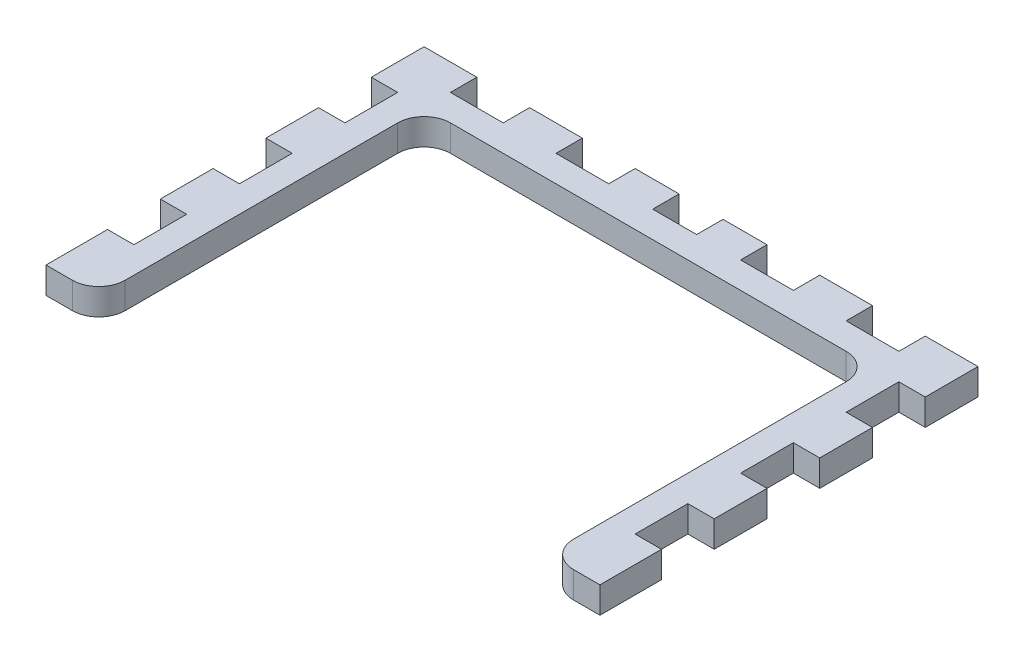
ISO-10303-21;
HEADER;
FILE_DESCRIPTION(('STEP AP214'),'2;1');
FILE_NAME('part.step','',(''),(''),'','','');
FILE_SCHEMA(('AUTOMOTIVE_DESIGN { 1 0 10303 214 1 1 1 1 }'));
ENDSEC;
DATA;
#1=APPLICATION_CONTEXT('core data for automotive mechanical design processes');
#2=APPLICATION_PROTOCOL_DEFINITION('international standard','automotive_design',2000,#1);
#3=PRODUCT_CONTEXT('',#1,'mechanical');
#4=PRODUCT('Part','Part','',(#3));
#5=PRODUCT_RELATED_PRODUCT_CATEGORY('part','',(#4));
#6=PRODUCT_DEFINITION_FORMATION('','',#4);
#7=PRODUCT_DEFINITION_CONTEXT('part definition',#1,'design');
#8=PRODUCT_DEFINITION('design','',#6,#7);
#9=PRODUCT_DEFINITION_SHAPE('','',#8);
#10=(LENGTH_UNIT() NAMED_UNIT(*) SI_UNIT(.MILLI.,.METRE.));
#11=(NAMED_UNIT(*) PLANE_ANGLE_UNIT() SI_UNIT($,.RADIAN.));
#12=(NAMED_UNIT(*) SI_UNIT($,.STERADIAN.) SOLID_ANGLE_UNIT());
#13=UNCERTAINTY_MEASURE_WITH_UNIT(LENGTH_MEASURE(1.E-05),#10,'distance_accuracy_value','');
#14=(GEOMETRIC_REPRESENTATION_CONTEXT(3) GLOBAL_UNCERTAINTY_ASSIGNED_CONTEXT((#13)) GLOBAL_UNIT_ASSIGNED_CONTEXT((#10,
#11,#12)) REPRESENTATION_CONTEXT('',''));
#15=CARTESIAN_POINT('',(0.,0.,0.));
#16=DIRECTION('',(0.,0.,1.));
#17=DIRECTION('',(1.,0.,0.));
#18=AXIS2_PLACEMENT_3D('',#15,#16,#17);
#19=CARTESIAN_POINT('',(-31.5,3.,-21.5));
#20=DIRECTION('',(0.,0.,1.));
#21=DIRECTION('',(1.,0.,0.));
#22=AXIS2_PLACEMENT_3D('',#19,#20,#21);
#23=PLANE('',#22);
#24=DIRECTION('',(-1.,0.,0.));
#25=VECTOR('',#24,1.);
#26=CARTESIAN_POINT('',(-31.5,3.,-21.5));
#27=LINE('',#26,#25);
#28=CARTESIAN_POINT('',(-2.5,3.,-21.5));
#29=VERTEX_POINT('',#28);
#30=CARTESIAN_POINT('',(-7.5,3.,-21.5));
#31=VERTEX_POINT('',#30);
#32=EDGE_CURVE('E609',#29,#31,#27,.T.);
#33=ORIENTED_EDGE('',*,*,#32,.F.);
#34=DIRECTION('',(0.,-1.,0.));
#35=VECTOR('',#34,1.);
#36=CARTESIAN_POINT('',(-2.5,3.,-21.5));
#37=LINE('',#36,#35);
#38=CARTESIAN_POINT('',(-2.5,0.,-21.5));
#39=VERTEX_POINT('',#38);
#40=EDGE_CURVE('E39',#29,#39,#37,.T.);
#41=ORIENTED_EDGE('',*,*,#40,.T.);
#42=DIRECTION('',(-1.,0.,0.));
#43=VECTOR('',#42,1.);
#44=CARTESIAN_POINT('',(-31.5,0.,-21.5));
#45=LINE('',#44,#43);
#46=CARTESIAN_POINT('',(-7.5,0.,-21.5));
#47=VERTEX_POINT('',#46);
#48=EDGE_CURVE('E629',#39,#47,#45,.T.);
#49=ORIENTED_EDGE('',*,*,#48,.T.);
#50=DIRECTION('',(0.,1.,0.));
#51=VECTOR('',#50,1.);
#52=CARTESIAN_POINT('',(-7.5,-7.,-21.5));
#53=LINE('',#52,#51);
#54=EDGE_CURVE('E515',#47,#31,#53,.T.);
#55=ORIENTED_EDGE('',*,*,#54,.T.);
#56=EDGE_LOOP('',(#33,#41,#49,#55));
#57=FACE_BOUND('',#56,.T.);
#58=ADVANCED_FACE('F31',(#57),#23,.F.);
#59=CARTESIAN_POINT('',(31.5,3.,-21.5));
#60=DIRECTION('',(0.,-1.,0.));
#61=DIRECTION('',(0.,0.,-1.));
#62=AXIS2_PLACEMENT_3D('',#59,#60,#61);
#63=PLANE('',#62);
#64=DIRECTION('',(1.,0.,0.));
#65=VECTOR('',#64,1.);
#66=CARTESIAN_POINT('',(-2.5,3.,-18.5));
#67=LINE('',#66,#65);
#68=CARTESIAN_POINT('',(-2.5,3.,-18.5));
#69=VERTEX_POINT('',#68);
#70=CARTESIAN_POINT('',(2.5,3.,-18.5));
#71=VERTEX_POINT('',#70);
#72=EDGE_CURVE('E389',#69,#71,#67,.T.);
#73=ORIENTED_EDGE('',*,*,#72,.F.);
#74=DIRECTION('',(0.,0.,1.));
#75=VECTOR('',#74,1.);
#76=CARTESIAN_POINT('',(-2.5,3.,-21.5));
#77=LINE('',#76,#75);
#78=EDGE_CURVE('E396',#29,#69,#77,.T.);
#79=ORIENTED_EDGE('',*,*,#78,.F.);
#80=ORIENTED_EDGE('',*,*,#32,.T.);
#81=DIRECTION('',(0.,0.,-1.));
#82=VECTOR('',#81,1.);
#83=CARTESIAN_POINT('',(-7.5,3.,-21.5));
#84=LINE('',#83,#82);
#85=CARTESIAN_POINT('',(-7.5,3.,-18.5));
#86=VERTEX_POINT('',#85);
#87=EDGE_CURVE('E508',#86,#31,#84,.T.);
#88=ORIENTED_EDGE('',*,*,#87,.F.);
#89=DIRECTION('',(1.,0.,0.));
#90=VECTOR('',#89,1.);
#91=CARTESIAN_POINT('',(-13.5,3.,-18.5));
#92=LINE('',#91,#90);
#93=CARTESIAN_POINT('',(-13.5,3.,-18.5));
#94=VERTEX_POINT('',#93);
#95=EDGE_CURVE('E505',#94,#86,#92,.T.);
#96=ORIENTED_EDGE('',*,*,#95,.F.);
#97=DIRECTION('',(0.,0.,1.));
#98=VECTOR('',#97,1.);
#99=CARTESIAN_POINT('',(-13.5,3.,-21.5));
#100=LINE('',#99,#98);
#101=CARTESIAN_POINT('',(-13.5,3.,-21.5));
#102=VERTEX_POINT('',#101);
#103=EDGE_CURVE('E497',#102,#94,#100,.T.);
#104=ORIENTED_EDGE('',*,*,#103,.F.);
#105=CARTESIAN_POINT('',(-19.5,3.,-21.5));
#106=VERTEX_POINT('',#105);
#107=EDGE_CURVE('E803',#102,#106,#27,.T.);
#108=ORIENTED_EDGE('',*,*,#107,.T.);
#109=DIRECTION('',(0.,0.,-1.));
#110=VECTOR('',#109,1.);
#111=CARTESIAN_POINT('',(-19.5,3.,-21.5));
#112=LINE('',#111,#110);
#113=CARTESIAN_POINT('',(-19.5,3.,-18.5));
#114=VERTEX_POINT('',#113);
#115=EDGE_CURVE('E526',#114,#106,#112,.T.);
#116=ORIENTED_EDGE('',*,*,#115,.F.);
#117=DIRECTION('',(1.,0.,0.));
#118=VECTOR('',#117,1.);
#119=CARTESIAN_POINT('',(-25.5,3.,-18.5));
#120=LINE('',#119,#118);
#121=CARTESIAN_POINT('',(-25.5,3.,-18.5));
#122=VERTEX_POINT('',#121);
#123=EDGE_CURVE('E523',#122,#114,#120,.T.);
#124=ORIENTED_EDGE('',*,*,#123,.F.);
#125=DIRECTION('',(0.,0.,1.));
#126=VECTOR('',#125,1.);
#127=CARTESIAN_POINT('',(-25.5,3.,-21.5));
#128=LINE('',#127,#126);
#129=CARTESIAN_POINT('',(-25.5,3.,-21.5));
#130=VERTEX_POINT('',#129);
#131=EDGE_CURVE('E514',#130,#122,#128,.T.);
#132=ORIENTED_EDGE('',*,*,#131,.F.);
#133=CARTESIAN_POINT('',(-31.5,3.,-21.5));
#134=VERTEX_POINT('',#133);
#135=EDGE_CURVE('E601',#130,#134,#27,.T.);
#136=ORIENTED_EDGE('',*,*,#135,.T.);
#137=DIRECTION('',(0.,0.,1.));
#138=VECTOR('',#137,1.);
#139=CARTESIAN_POINT('',(-31.5,3.,21.5));
#140=LINE('',#139,#138);
#141=CARTESIAN_POINT('',(-31.5,3.,-15.5));
#142=VERTEX_POINT('',#141);
#143=EDGE_CURVE('E610',#134,#142,#140,.T.);
#144=ORIENTED_EDGE('',*,*,#143,.T.);
#145=DIRECTION('',(-1.,0.,0.));
#146=VECTOR('',#145,1.);
#147=CARTESIAN_POINT('',(-31.5,3.,-15.5));
#148=LINE('',#147,#146);
#149=CARTESIAN_POINT('',(-28.5,3.,-15.5));
#150=VERTEX_POINT('',#149);
#151=EDGE_CURVE('E578',#150,#142,#148,.T.);
#152=ORIENTED_EDGE('',*,*,#151,.F.);
#153=DIRECTION('',(0.,0.,-1.));
#154=VECTOR('',#153,1.);
#155=CARTESIAN_POINT('',(-28.5,3.,-15.5));
#156=LINE('',#155,#154);
#157=CARTESIAN_POINT('',(-28.5,3.,-9.5));
#158=VERTEX_POINT('',#157);
#159=EDGE_CURVE('E575',#158,#150,#156,.T.);
#160=ORIENTED_EDGE('',*,*,#159,.F.);
#161=DIRECTION('',(1.,0.,0.));
#162=VECTOR('',#161,1.);
#163=CARTESIAN_POINT('',(-31.5,3.,-9.5));
#164=LINE('',#163,#162);
#165=CARTESIAN_POINT('',(-31.5,3.,-9.5));
#166=VERTEX_POINT('',#165);
#167=EDGE_CURVE('E567',#166,#158,#164,.T.);
#168=ORIENTED_EDGE('',*,*,#167,.F.);
#169=CARTESIAN_POINT('',(-31.5,3.,-3.5));
#170=VERTEX_POINT('',#169);
#171=EDGE_CURVE('E614',#166,#170,#140,.T.);
#172=ORIENTED_EDGE('',*,*,#171,.T.);
#173=DIRECTION('',(-1.,0.,0.));
#174=VECTOR('',#173,1.);
#175=CARTESIAN_POINT('',(-31.5,3.,-3.5));
#176=LINE('',#175,#174);
#177=CARTESIAN_POINT('',(-28.5,3.,-3.5));
#178=VERTEX_POINT('',#177);
#179=EDGE_CURVE('E561',#178,#170,#176,.T.);
#180=ORIENTED_EDGE('',*,*,#179,.F.);
#181=DIRECTION('',(0.,0.,-1.));
#182=VECTOR('',#181,1.);
#183=CARTESIAN_POINT('',(-28.5,3.,-3.5));
#184=LINE('',#183,#182);
#185=CARTESIAN_POINT('',(-28.5,3.,2.5));
#186=VERTEX_POINT('',#185);
#187=EDGE_CURVE('E558',#186,#178,#184,.T.);
#188=ORIENTED_EDGE('',*,*,#187,.F.);
#189=DIRECTION('',(1.,0.,0.));
#190=VECTOR('',#189,1.);
#191=CARTESIAN_POINT('',(-31.5,3.,2.5));
#192=LINE('',#191,#190);
#193=CARTESIAN_POINT('',(-31.5,3.,2.5));
#194=VERTEX_POINT('',#193);
#195=EDGE_CURVE('E550',#194,#186,#192,.T.);
#196=ORIENTED_EDGE('',*,*,#195,.F.);
#197=CARTESIAN_POINT('',(-31.5,3.,8.5));
#198=VERTEX_POINT('',#197);
#199=EDGE_CURVE('E839',#194,#198,#140,.T.);
#200=ORIENTED_EDGE('',*,*,#199,.T.);
#201=DIRECTION('',(-1.,0.,0.));
#202=VECTOR('',#201,1.);
#203=CARTESIAN_POINT('',(-31.5,3.,8.5));
#204=LINE('',#203,#202);
#205=CARTESIAN_POINT('',(-28.5,3.,8.5));
#206=VERTEX_POINT('',#205);
#207=EDGE_CURVE('E544',#206,#198,#204,.T.);
#208=ORIENTED_EDGE('',*,*,#207,.F.);
#209=DIRECTION('',(0.,0.,-1.));
#210=VECTOR('',#209,1.);
#211=CARTESIAN_POINT('',(-28.5,3.,8.5));
#212=LINE('',#211,#210);
#213=CARTESIAN_POINT('',(-28.5,3.,14.5));
#214=VERTEX_POINT('',#213);
#215=EDGE_CURVE('E541',#214,#206,#212,.T.);
#216=ORIENTED_EDGE('',*,*,#215,.F.);
#217=DIRECTION('',(1.,0.,0.));
#218=VECTOR('',#217,1.);
#219=CARTESIAN_POINT('',(-31.5,3.,14.5));
#220=LINE('',#219,#218);
#221=CARTESIAN_POINT('',(-31.5,3.,14.5));
#222=VERTEX_POINT('',#221);
#223=EDGE_CURVE('E532',#222,#214,#220,.T.);
#224=ORIENTED_EDGE('',*,*,#223,.F.);
#225=CARTESIAN_POINT('',(-31.5,3.,21.5));
#226=VERTEX_POINT('',#225);
#227=EDGE_CURVE('E607',#222,#226,#140,.T.);
#228=ORIENTED_EDGE('',*,*,#227,.T.);
#229=DIRECTION('',(1.,0.,0.));
#230=VECTOR('',#229,1.);
#231=CARTESIAN_POINT('',(-31.5,3.,21.5));
#232=LINE('',#231,#230);
#233=CARTESIAN_POINT('',(-28.5,3.,21.5));
#234=VERTEX_POINT('',#233);
#235=EDGE_CURVE('E615',#226,#234,#232,.T.);
#236=ORIENTED_EDGE('',*,*,#235,.T.);
#237=CARTESIAN_POINT('',(-28.5,3.,18.5));
#238=DIRECTION('',(0.,-1.,0.));
#239=DIRECTION('',(0.,0.,-1.));
#240=AXIS2_PLACEMENT_3D('',#237,#238,#239);
#241=CIRCLE('',#240,3.);
#242=CARTESIAN_POINT('',(-25.5,3.,18.5));
#243=VERTEX_POINT('',#242);
#244=EDGE_CURVE('E662',#234,#243,#241,.F.);
#245=ORIENTED_EDGE('',*,*,#244,.T.);
#246=DIRECTION('',(0.,0.,1.));
#247=VECTOR('',#246,1.);
#248=CARTESIAN_POINT('',(-25.5,3.,-15.5));
#249=LINE('',#248,#247);
#250=CARTESIAN_POINT('',(-25.5,3.,-12.5));
#251=VERTEX_POINT('',#250);
#252=EDGE_CURVE('E595',#251,#243,#249,.T.);
#253=ORIENTED_EDGE('',*,*,#252,.F.);
#254=CARTESIAN_POINT('',(-22.5,3.,-12.5));
#255=DIRECTION('',(0.,-1.,0.));
#256=DIRECTION('',(0.,0.,-1.));
#257=AXIS2_PLACEMENT_3D('',#254,#255,#256);
#258=CIRCLE('',#257,3.);
#259=CARTESIAN_POINT('',(-22.5,3.,-15.5));
#260=VERTEX_POINT('',#259);
#261=EDGE_CURVE('E691',#251,#260,#258,.T.);
#262=ORIENTED_EDGE('',*,*,#261,.T.);
#263=DIRECTION('',(-1.,0.,0.));
#264=VECTOR('',#263,1.);
#265=CARTESIAN_POINT('',(-25.5,3.,-15.5));
#266=LINE('',#265,#264);
#267=CARTESIAN_POINT('',(22.5,3.,-15.5));
#268=VERTEX_POINT('',#267);
#269=EDGE_CURVE('E592',#268,#260,#266,.T.);
#270=ORIENTED_EDGE('',*,*,#269,.F.);
#271=CARTESIAN_POINT('',(22.5,3.,-12.5));
#272=DIRECTION('',(0.,-1.,0.));
#273=DIRECTION('',(0.,0.,-1.));
#274=AXIS2_PLACEMENT_3D('',#271,#272,#273);
#275=CIRCLE('',#274,3.);
#276=CARTESIAN_POINT('',(25.5,3.,-12.5));
#277=VERTEX_POINT('',#276);
#278=EDGE_CURVE('E687',#268,#277,#275,.T.);
#279=ORIENTED_EDGE('',*,*,#278,.T.);
#280=DIRECTION('',(0.,0.,-1.));
#281=VECTOR('',#280,1.);
#282=CARTESIAN_POINT('',(25.5,3.,-15.5));
#283=LINE('',#282,#281);
#284=CARTESIAN_POINT('',(25.5,3.,18.5));
#285=VERTEX_POINT('',#284);
#286=EDGE_CURVE('E584',#285,#277,#283,.T.);
#287=ORIENTED_EDGE('',*,*,#286,.F.);
#288=CARTESIAN_POINT('',(28.5,3.,18.5));
#289=DIRECTION('',(0.,-1.,0.));
#290=DIRECTION('',(0.,0.,-1.));
#291=AXIS2_PLACEMENT_3D('',#288,#289,#290);
#292=CIRCLE('',#291,3.);
#293=CARTESIAN_POINT('',(28.5,3.,21.5));
#294=VERTEX_POINT('',#293);
#295=EDGE_CURVE('E660',#285,#294,#292,.F.);
#296=ORIENTED_EDGE('',*,*,#295,.T.);
#297=CARTESIAN_POINT('',(31.5,3.,21.5));
#298=VERTEX_POINT('',#297);
#299=EDGE_CURVE('E613',#294,#298,#232,.T.);
#300=ORIENTED_EDGE('',*,*,#299,.T.);
#301=DIRECTION('',(0.,0.,-1.));
#302=VECTOR('',#301,1.);
#303=CARTESIAN_POINT('',(31.5,3.,21.5));
#304=LINE('',#303,#302);
#305=CARTESIAN_POINT('',(31.5,3.,14.5));
#306=VERTEX_POINT('',#305);
#307=EDGE_CURVE('E598',#298,#306,#304,.T.);
#308=ORIENTED_EDGE('',*,*,#307,.T.);
#309=DIRECTION('',(-1.,0.,0.));
#310=VECTOR('',#309,1.);
#311=CARTESIAN_POINT('',(31.5,3.,14.5));
#312=LINE('',#311,#310);
#313=CARTESIAN_POINT('',(28.5,3.,14.5));
#314=VERTEX_POINT('',#313);
#315=EDGE_CURVE('E454',#306,#314,#312,.T.);
#316=ORIENTED_EDGE('',*,*,#315,.T.);
#317=DIRECTION('',(0.,0.,-1.));
#318=VECTOR('',#317,1.);
#319=CARTESIAN_POINT('',(28.5,3.,8.5));
#320=LINE('',#319,#318);
#321=CARTESIAN_POINT('',(28.5,3.,8.5));
#322=VERTEX_POINT('',#321);
#323=EDGE_CURVE('E451',#314,#322,#320,.T.);
#324=ORIENTED_EDGE('',*,*,#323,.T.);
#325=DIRECTION('',(1.,0.,0.));
#326=VECTOR('',#325,1.);
#327=CARTESIAN_POINT('',(31.5,3.,8.5));
#328=LINE('',#327,#326);
#329=CARTESIAN_POINT('',(31.5,3.,8.5));
#330=VERTEX_POINT('',#329);
#331=EDGE_CURVE('E448',#322,#330,#328,.T.);
#332=ORIENTED_EDGE('',*,*,#331,.T.);
#333=CARTESIAN_POINT('',(31.5,3.,2.5));
#334=VERTEX_POINT('',#333);
#335=EDGE_CURVE('E602',#330,#334,#304,.T.);
#336=ORIENTED_EDGE('',*,*,#335,.T.);
#337=DIRECTION('',(-1.,0.,0.));
#338=VECTOR('',#337,1.);
#339=CARTESIAN_POINT('',(31.5,3.,2.5));
#340=LINE('',#339,#338);
#341=CARTESIAN_POINT('',(28.5,3.,2.5));
#342=VERTEX_POINT('',#341);
#343=EDGE_CURVE('E472',#334,#342,#340,.T.);
#344=ORIENTED_EDGE('',*,*,#343,.T.);
#345=DIRECTION('',(0.,0.,-1.));
#346=VECTOR('',#345,1.);
#347=CARTESIAN_POINT('',(28.5,3.,-3.5));
#348=LINE('',#347,#346);
#349=CARTESIAN_POINT('',(28.5,3.,-3.5));
#350=VERTEX_POINT('',#349);
#351=EDGE_CURVE('E469',#342,#350,#348,.T.);
#352=ORIENTED_EDGE('',*,*,#351,.T.);
#353=DIRECTION('',(1.,0.,0.));
#354=VECTOR('',#353,1.);
#355=CARTESIAN_POINT('',(31.5,3.,-3.5));
#356=LINE('',#355,#354);
#357=CARTESIAN_POINT('',(31.5,3.,-3.5));
#358=VERTEX_POINT('',#357);
#359=EDGE_CURVE('E461',#350,#358,#356,.T.);
#360=ORIENTED_EDGE('',*,*,#359,.T.);
#361=CARTESIAN_POINT('',(31.5,3.,-9.5));
#362=VERTEX_POINT('',#361);
#363=EDGE_CURVE('E913',#358,#362,#304,.T.);
#364=ORIENTED_EDGE('',*,*,#363,.T.);
#365=DIRECTION('',(-1.,0.,0.));
#366=VECTOR('',#365,1.);
#367=CARTESIAN_POINT('',(31.5,3.,-9.5));
#368=LINE('',#367,#366);
#369=CARTESIAN_POINT('',(28.5,3.,-9.5));
#370=VERTEX_POINT('',#369);
#371=EDGE_CURVE('E490',#362,#370,#368,.T.);
#372=ORIENTED_EDGE('',*,*,#371,.T.);
#373=DIRECTION('',(0.,0.,-1.));
#374=VECTOR('',#373,1.);
#375=CARTESIAN_POINT('',(28.5,3.,-15.5));
#376=LINE('',#375,#374);
#377=CARTESIAN_POINT('',(28.5,3.,-15.5));
#378=VERTEX_POINT('',#377);
#379=EDGE_CURVE('E487',#370,#378,#376,.T.);
#380=ORIENTED_EDGE('',*,*,#379,.T.);
#381=DIRECTION('',(1.,0.,0.));
#382=VECTOR('',#381,1.);
#383=CARTESIAN_POINT('',(31.5,3.,-15.5));
#384=LINE('',#383,#382);
#385=CARTESIAN_POINT('',(31.5,3.,-15.5));
#386=VERTEX_POINT('',#385);
#387=EDGE_CURVE('E479',#378,#386,#384,.T.);
#388=ORIENTED_EDGE('',*,*,#387,.T.);
#389=CARTESIAN_POINT('',(31.5,3.,-21.5));
#390=VERTEX_POINT('',#389);
#391=EDGE_CURVE('E603',#386,#390,#304,.T.);
#392=ORIENTED_EDGE('',*,*,#391,.T.);
#393=CARTESIAN_POINT('',(25.5,3.,-21.5));
#394=VERTEX_POINT('',#393);
#395=EDGE_CURVE('E604',#390,#394,#27,.T.);
#396=ORIENTED_EDGE('',*,*,#395,.T.);
#397=DIRECTION('',(0.,0.,1.));
#398=VECTOR('',#397,1.);
#399=CARTESIAN_POINT('',(25.5,3.,-21.5));
#400=LINE('',#399,#398);
#401=CARTESIAN_POINT('',(25.5,3.,-18.5));
#402=VERTEX_POINT('',#401);
#403=EDGE_CURVE('E429',#394,#402,#400,.T.);
#404=ORIENTED_EDGE('',*,*,#403,.T.);
#405=DIRECTION('',(-1.,0.,0.));
#406=VECTOR('',#405,1.);
#407=CARTESIAN_POINT('',(25.5,3.,-18.5));
#408=LINE('',#407,#406);
#409=CARTESIAN_POINT('',(19.5,3.,-18.5));
#410=VERTEX_POINT('',#409);
#411=EDGE_CURVE('E435',#402,#410,#408,.T.);
#412=ORIENTED_EDGE('',*,*,#411,.T.);
#413=DIRECTION('',(0.,0.,-1.));
#414=VECTOR('',#413,1.);
#415=CARTESIAN_POINT('',(19.5,3.,-21.5));
#416=LINE('',#415,#414);
#417=CARTESIAN_POINT('',(19.5,3.,-21.5));
#418=VERTEX_POINT('',#417);
#419=EDGE_CURVE('E432',#410,#418,#416,.T.);
#420=ORIENTED_EDGE('',*,*,#419,.T.);
#421=CARTESIAN_POINT('',(13.5,3.,-21.5));
#422=VERTEX_POINT('',#421);
#423=EDGE_CURVE('E608',#418,#422,#27,.T.);
#424=ORIENTED_EDGE('',*,*,#423,.T.);
#425=DIRECTION('',(0.,0.,1.));
#426=VECTOR('',#425,1.);
#427=CARTESIAN_POINT('',(13.5,3.,-21.5));
#428=LINE('',#427,#426);
#429=CARTESIAN_POINT('',(13.5,3.,-18.5));
#430=VERTEX_POINT('',#429);
#431=EDGE_CURVE('E412',#422,#430,#428,.T.);
#432=ORIENTED_EDGE('',*,*,#431,.T.);
#433=DIRECTION('',(-1.,0.,0.));
#434=VECTOR('',#433,1.);
#435=CARTESIAN_POINT('',(13.5,3.,-18.5));
#436=LINE('',#435,#434);
#437=CARTESIAN_POINT('',(7.5,3.,-18.5));
#438=VERTEX_POINT('',#437);
#439=EDGE_CURVE('E418',#430,#438,#436,.T.);
#440=ORIENTED_EDGE('',*,*,#439,.T.);
#441=DIRECTION('',(0.,0.,-1.));
#442=VECTOR('',#441,1.);
#443=CARTESIAN_POINT('',(7.5,3.,-21.5));
#444=LINE('',#443,#442);
#445=CARTESIAN_POINT('',(7.5,3.,-21.5));
#446=VERTEX_POINT('',#445);
#447=EDGE_CURVE('E415',#438,#446,#444,.T.);
#448=ORIENTED_EDGE('',*,*,#447,.T.);
#449=CARTESIAN_POINT('',(2.5,3.,-21.5));
#450=VERTEX_POINT('',#449);
#451=EDGE_CURVE('E802',#446,#450,#27,.T.);
#452=ORIENTED_EDGE('',*,*,#451,.T.);
#453=DIRECTION('',(0.,0.,-1.));
#454=VECTOR('',#453,1.);
#455=CARTESIAN_POINT('',(2.5,3.,-21.5));
#456=LINE('',#455,#454);
#457=EDGE_CURVE('E46',#71,#450,#456,.T.);
#458=ORIENTED_EDGE('',*,*,#457,.F.);
#459=EDGE_LOOP('',(#73,#79,#80,#88,#96,#104,#108,#116,#124,#132,#136,#144,#152,#160,#168,#172,
#180,#188,#196,#200,#208,#216,#224,#228,#236,#245,#253,#262,#270,#279,#287,#296,#300,#308,#316,
#324,#332,#336,#344,#352,#360,#364,#372,#380,#388,#392,#396,#404,#412,#420,#424,#432,#440,#448,
#452,#458));
#460=FACE_BOUND('',#459,.T.);
#461=ADVANCED_FACE('F402',(#460),#63,.F.);
#462=CARTESIAN_POINT('',(31.5,0.,-21.5));
#463=DIRECTION('',(0.,-1.,0.));
#464=DIRECTION('',(0.,0.,-1.));
#465=AXIS2_PLACEMENT_3D('',#462,#463,#464);
#466=PLANE('',#465);
#467=DIRECTION('',(0.,0.,-1.));
#468=VECTOR('',#467,1.);
#469=CARTESIAN_POINT('',(-2.5,0.,-21.5));
#470=LINE('',#469,#468);
#471=CARTESIAN_POINT('',(-2.5,0.,-18.5));
#472=VERTEX_POINT('',#471);
#473=EDGE_CURVE('E410',#472,#39,#470,.T.);
#474=ORIENTED_EDGE('',*,*,#473,.F.);
#475=DIRECTION('',(-1.,0.,0.));
#476=VECTOR('',#475,1.);
#477=CARTESIAN_POINT('',(31.5,0.,-18.5));
#478=LINE('',#477,#476);
#479=CARTESIAN_POINT('',(2.5,0.,-18.5));
#480=VERTEX_POINT('',#479);
#481=EDGE_CURVE('E11',#480,#472,#478,.T.);
#482=ORIENTED_EDGE('',*,*,#481,.F.);
#483=DIRECTION('',(0.,0.,1.));
#484=VECTOR('',#483,1.);
#485=CARTESIAN_POINT('',(2.5,0.,-21.5));
#486=LINE('',#485,#484);
#487=CARTESIAN_POINT('',(2.5,0.,-21.5));
#488=VERTEX_POINT('',#487);
#489=EDGE_CURVE('E407',#488,#480,#486,.T.);
#490=ORIENTED_EDGE('',*,*,#489,.F.);
#491=CARTESIAN_POINT('',(7.50000000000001,0.,-21.5));
#492=VERTEX_POINT('',#491);
#493=EDGE_CURVE('E779',#492,#488,#45,.T.);
#494=ORIENTED_EDGE('',*,*,#493,.F.);
#495=DIRECTION('',(0.,0.,1.));
#496=VECTOR('',#495,1.);
#497=CARTESIAN_POINT('',(7.5,0.,-21.5));
#498=LINE('',#497,#496);
#499=CARTESIAN_POINT('',(7.5,0.,-18.5));
#500=VERTEX_POINT('',#499);
#501=EDGE_CURVE('E54',#492,#500,#498,.T.);
#502=ORIENTED_EDGE('',*,*,#501,.T.);
#503=DIRECTION('',(1.,0.,0.));
#504=VECTOR('',#503,1.);
#505=CARTESIAN_POINT('',(31.5,0.,-18.5));
#506=LINE('',#505,#504);
#507=CARTESIAN_POINT('',(13.5,0.,-18.5));
#508=VERTEX_POINT('',#507);
#509=EDGE_CURVE('E768',#500,#508,#506,.T.);
#510=ORIENTED_EDGE('',*,*,#509,.T.);
#511=DIRECTION('',(0.,0.,-1.));
#512=VECTOR('',#511,1.);
#513=CARTESIAN_POINT('',(13.5,0.,-21.5));
#514=LINE('',#513,#512);
#515=CARTESIAN_POINT('',(13.5,0.,-21.5));
#516=VERTEX_POINT('',#515);
#517=EDGE_CURVE('E426',#508,#516,#514,.T.);
#518=ORIENTED_EDGE('',*,*,#517,.T.);
#519=CARTESIAN_POINT('',(19.5,0.,-21.5));
#520=VERTEX_POINT('',#519);
#521=EDGE_CURVE('E628',#520,#516,#45,.T.);
#522=ORIENTED_EDGE('',*,*,#521,.F.);
#523=DIRECTION('',(0.,0.,1.));
#524=VECTOR('',#523,1.);
#525=CARTESIAN_POINT('',(19.5,0.,-21.5));
#526=LINE('',#525,#524);
#527=CARTESIAN_POINT('',(19.5,0.,-18.5));
#528=VERTEX_POINT('',#527);
#529=EDGE_CURVE('E441',#520,#528,#526,.T.);
#530=ORIENTED_EDGE('',*,*,#529,.T.);
#531=DIRECTION('',(1.,0.,0.));
#532=VECTOR('',#531,1.);
#533=CARTESIAN_POINT('',(31.5,0.,-18.5));
#534=LINE('',#533,#532);
#535=CARTESIAN_POINT('',(25.5,0.,-18.5));
#536=VERTEX_POINT('',#535);
#537=EDGE_CURVE('E761',#528,#536,#534,.T.);
#538=ORIENTED_EDGE('',*,*,#537,.T.);
#539=DIRECTION('',(0.,0.,-1.));
#540=VECTOR('',#539,1.);
#541=CARTESIAN_POINT('',(25.5,0.,-21.5));
#542=LINE('',#541,#540);
#543=CARTESIAN_POINT('',(25.5,0.,-21.5));
#544=VERTEX_POINT('',#543);
#545=EDGE_CURVE('E445',#536,#544,#542,.T.);
#546=ORIENTED_EDGE('',*,*,#545,.T.);
#547=CARTESIAN_POINT('',(31.5,0.,-21.5));
#548=VERTEX_POINT('',#547);
#549=EDGE_CURVE('E624',#548,#544,#45,.T.);
#550=ORIENTED_EDGE('',*,*,#549,.F.);
#551=DIRECTION('',(0.,0.,-1.));
#552=VECTOR('',#551,1.);
#553=CARTESIAN_POINT('',(31.5,0.,21.5));
#554=LINE('',#553,#552);
#555=CARTESIAN_POINT('',(31.5,0.,-15.5));
#556=VERTEX_POINT('',#555);
#557=EDGE_CURVE('E597',#556,#548,#554,.T.);
#558=ORIENTED_EDGE('',*,*,#557,.F.);
#559=DIRECTION('',(-1.,0.,0.));
#560=VECTOR('',#559,1.);
#561=CARTESIAN_POINT('',(31.5,0.,-15.5));
#562=LINE('',#561,#560);
#563=CARTESIAN_POINT('',(28.5,0.,-15.5));
#564=VERTEX_POINT('',#563);
#565=EDGE_CURVE('E730',#556,#564,#562,.T.);
#566=ORIENTED_EDGE('',*,*,#565,.T.);
#567=DIRECTION('',(0.,0.,1.));
#568=VECTOR('',#567,1.);
#569=CARTESIAN_POINT('',(28.5,0.,-21.5));
#570=LINE('',#569,#568);
#571=CARTESIAN_POINT('',(28.5,0.,-9.5));
#572=VERTEX_POINT('',#571);
#573=EDGE_CURVE('E733',#564,#572,#570,.T.);
#574=ORIENTED_EDGE('',*,*,#573,.T.);
#575=DIRECTION('',(1.,0.,0.));
#576=VECTOR('',#575,1.);
#577=CARTESIAN_POINT('',(31.5,0.,-9.5));
#578=LINE('',#577,#576);
#579=CARTESIAN_POINT('',(31.5,0.,-9.5));
#580=VERTEX_POINT('',#579);
#581=EDGE_CURVE('E736',#572,#580,#578,.T.);
#582=ORIENTED_EDGE('',*,*,#581,.T.);
#583=CARTESIAN_POINT('',(31.5,0.,-3.5));
#584=VERTEX_POINT('',#583);
#585=EDGE_CURVE('E928',#584,#580,#554,.T.);
#586=ORIENTED_EDGE('',*,*,#585,.F.);
#587=DIRECTION('',(-1.,0.,0.));
#588=VECTOR('',#587,1.);
#589=CARTESIAN_POINT('',(31.5,0.,-3.5));
#590=LINE('',#589,#588);
#591=CARTESIAN_POINT('',(28.5,0.,-3.5));
#592=VERTEX_POINT('',#591);
#593=EDGE_CURVE('E739',#584,#592,#590,.T.);
#594=ORIENTED_EDGE('',*,*,#593,.T.);
#595=DIRECTION('',(0.,0.,1.));
#596=VECTOR('',#595,1.);
#597=CARTESIAN_POINT('',(28.5,0.,-21.5));
#598=LINE('',#597,#596);
#599=CARTESIAN_POINT('',(28.5,0.,2.5));
#600=VERTEX_POINT('',#599);
#601=EDGE_CURVE('E742',#592,#600,#598,.T.);
#602=ORIENTED_EDGE('',*,*,#601,.T.);
#603=DIRECTION('',(1.,0.,0.));
#604=VECTOR('',#603,1.);
#605=CARTESIAN_POINT('',(31.5,0.,2.5));
#606=LINE('',#605,#604);
#607=CARTESIAN_POINT('',(31.5,0.,2.5));
#608=VERTEX_POINT('',#607);
#609=EDGE_CURVE('E745',#600,#608,#606,.T.);
#610=ORIENTED_EDGE('',*,*,#609,.T.);
#611=CARTESIAN_POINT('',(31.5,0.,8.5));
#612=VERTEX_POINT('',#611);
#613=EDGE_CURVE('E623',#612,#608,#554,.T.);
#614=ORIENTED_EDGE('',*,*,#613,.F.);
#615=DIRECTION('',(-1.,0.,0.));
#616=VECTOR('',#615,1.);
#617=CARTESIAN_POINT('',(31.5,0.,8.5));
#618=LINE('',#617,#616);
#619=CARTESIAN_POINT('',(28.5,0.,8.5));
#620=VERTEX_POINT('',#619);
#621=EDGE_CURVE('E748',#612,#620,#618,.T.);
#622=ORIENTED_EDGE('',*,*,#621,.T.);
#623=DIRECTION('',(0.,0.,1.));
#624=VECTOR('',#623,1.);
#625=CARTESIAN_POINT('',(28.5,0.,-21.5));
#626=LINE('',#625,#624);
#627=CARTESIAN_POINT('',(28.5,0.,14.5));
#628=VERTEX_POINT('',#627);
#629=EDGE_CURVE('E751',#620,#628,#626,.T.);
#630=ORIENTED_EDGE('',*,*,#629,.T.);
#631=DIRECTION('',(1.,0.,0.));
#632=VECTOR('',#631,1.);
#633=CARTESIAN_POINT('',(31.5,0.,14.5));
#634=LINE('',#633,#632);
#635=CARTESIAN_POINT('',(31.5,0.,14.5));
#636=VERTEX_POINT('',#635);
#637=EDGE_CURVE('E754',#628,#636,#634,.T.);
#638=ORIENTED_EDGE('',*,*,#637,.T.);
#639=CARTESIAN_POINT('',(31.5,0.,21.5));
#640=VERTEX_POINT('',#639);
#641=EDGE_CURVE('E619',#640,#636,#554,.T.);
#642=ORIENTED_EDGE('',*,*,#641,.F.);
#643=DIRECTION('',(1.,0.,0.));
#644=VECTOR('',#643,1.);
#645=CARTESIAN_POINT('',(-31.5,0.,21.5));
#646=LINE('',#645,#644);
#647=CARTESIAN_POINT('',(28.5,0.,21.5));
#648=VERTEX_POINT('',#647);
#649=EDGE_CURVE('E633',#648,#640,#646,.T.);
#650=ORIENTED_EDGE('',*,*,#649,.F.);
#651=CARTESIAN_POINT('',(28.5,0.,18.5));
#652=DIRECTION('',(0.,-1.,0.));
#653=DIRECTION('',(0.,0.,-1.));
#654=AXIS2_PLACEMENT_3D('',#651,#652,#653);
#655=CIRCLE('',#654,3.);
#656=CARTESIAN_POINT('',(25.5,0.,18.5));
#657=VERTEX_POINT('',#656);
#658=EDGE_CURVE('E667',#648,#657,#655,.T.);
#659=ORIENTED_EDGE('',*,*,#658,.T.);
#660=DIRECTION('',(0.,0.,1.));
#661=VECTOR('',#660,1.);
#662=CARTESIAN_POINT('',(25.5,0.,-21.5));
#663=LINE('',#662,#661);
#664=CARTESIAN_POINT('',(25.5,0.,-12.5));
#665=VERTEX_POINT('',#664);
#666=EDGE_CURVE('E655',#665,#657,#663,.T.);
#667=ORIENTED_EDGE('',*,*,#666,.F.);
#668=CARTESIAN_POINT('',(22.5,0.,-12.5));
#669=DIRECTION('',(0.,-1.,0.));
#670=DIRECTION('',(0.,0.,-1.));
#671=AXIS2_PLACEMENT_3D('',#668,#669,#670);
#672=CIRCLE('',#671,3.);
#673=CARTESIAN_POINT('',(22.5,0.,-15.5));
#674=VERTEX_POINT('',#673);
#675=EDGE_CURVE('E689',#665,#674,#672,.F.);
#676=ORIENTED_EDGE('',*,*,#675,.T.);
#677=DIRECTION('',(1.,0.,0.));
#678=VECTOR('',#677,1.);
#679=CARTESIAN_POINT('',(31.5,0.,-15.5));
#680=LINE('',#679,#678);
#681=CARTESIAN_POINT('',(-22.5,0.,-15.5));
#682=VERTEX_POINT('',#681);
#683=EDGE_CURVE('E649',#682,#674,#680,.T.);
#684=ORIENTED_EDGE('',*,*,#683,.F.);
#685=CARTESIAN_POINT('',(-22.5,0.,-12.5));
#686=DIRECTION('',(0.,-1.,0.));
#687=DIRECTION('',(0.,0.,-1.));
#688=AXIS2_PLACEMENT_3D('',#685,#686,#687);
#689=CIRCLE('',#688,3.);
#690=CARTESIAN_POINT('',(-25.5,0.,-12.5));
#691=VERTEX_POINT('',#690);
#692=EDGE_CURVE('E693',#682,#691,#689,.F.);
#693=ORIENTED_EDGE('',*,*,#692,.T.);
#694=DIRECTION('',(0.,0.,-1.));
#695=VECTOR('',#694,1.);
#696=CARTESIAN_POINT('',(-25.5,0.,-21.5));
#697=LINE('',#696,#695);
#698=CARTESIAN_POINT('',(-25.5,0.,18.5));
#699=VERTEX_POINT('',#698);
#700=EDGE_CURVE('E652',#699,#691,#697,.T.);
#701=ORIENTED_EDGE('',*,*,#700,.F.);
#702=CARTESIAN_POINT('',(-28.5,0.,18.5));
#703=DIRECTION('',(0.,-1.,0.));
#704=DIRECTION('',(0.,0.,-1.));
#705=AXIS2_PLACEMENT_3D('',#702,#703,#704);
#706=CIRCLE('',#705,3.);
#707=CARTESIAN_POINT('',(-28.5,0.,21.5));
#708=VERTEX_POINT('',#707);
#709=EDGE_CURVE('E670',#699,#708,#706,.T.);
#710=ORIENTED_EDGE('',*,*,#709,.T.);
#711=CARTESIAN_POINT('',(-31.5,0.,21.5));
#712=VERTEX_POINT('',#711);
#713=EDGE_CURVE('E635',#712,#708,#646,.T.);
#714=ORIENTED_EDGE('',*,*,#713,.F.);
#715=DIRECTION('',(0.,0.,1.));
#716=VECTOR('',#715,1.);
#717=CARTESIAN_POINT('',(-31.5,0.,21.5));
#718=LINE('',#717,#716);
#719=CARTESIAN_POINT('',(-31.5,0.,14.5));
#720=VERTEX_POINT('',#719);
#721=EDGE_CURVE('E627',#720,#712,#718,.T.);
#722=ORIENTED_EDGE('',*,*,#721,.F.);
#723=DIRECTION('',(-1.,0.,0.));
#724=VECTOR('',#723,1.);
#725=CARTESIAN_POINT('',(31.5,0.,14.5));
#726=LINE('',#725,#724);
#727=CARTESIAN_POINT('',(-28.5,0.,14.5));
#728=VERTEX_POINT('',#727);
#729=EDGE_CURVE('E709',#728,#720,#726,.T.);
#730=ORIENTED_EDGE('',*,*,#729,.F.);
#731=DIRECTION('',(0.,0.,1.));
#732=VECTOR('',#731,1.);
#733=CARTESIAN_POINT('',(-28.5,0.,-21.5));
#734=LINE('',#733,#732);
#735=CARTESIAN_POINT('',(-28.5,0.,8.5));
#736=VERTEX_POINT('',#735);
#737=EDGE_CURVE('E711',#736,#728,#734,.T.);
#738=ORIENTED_EDGE('',*,*,#737,.F.);
#739=DIRECTION('',(1.,0.,0.));
#740=VECTOR('',#739,1.);
#741=CARTESIAN_POINT('',(31.5,0.,8.5));
#742=LINE('',#741,#740);
#743=CARTESIAN_POINT('',(-31.5,0.,8.5));
#744=VERTEX_POINT('',#743);
#745=EDGE_CURVE('E714',#744,#736,#742,.T.);
#746=ORIENTED_EDGE('',*,*,#745,.F.);
#747=CARTESIAN_POINT('',(-31.5,0.,2.5));
#748=VERTEX_POINT('',#747);
#749=EDGE_CURVE('E1460',#748,#744,#718,.T.);
#750=ORIENTED_EDGE('',*,*,#749,.F.);
#751=DIRECTION('',(-1.,0.,0.));
#752=VECTOR('',#751,1.);
#753=CARTESIAN_POINT('',(31.5,0.,2.5));
#754=LINE('',#753,#752);
#755=CARTESIAN_POINT('',(-28.5,0.,2.5));
#756=VERTEX_POINT('',#755);
#757=EDGE_CURVE('E702',#756,#748,#754,.T.);
#758=ORIENTED_EDGE('',*,*,#757,.F.);
#759=DIRECTION('',(0.,0.,1.));
#760=VECTOR('',#759,1.);
#761=CARTESIAN_POINT('',(-28.5,0.,-21.5));
#762=LINE('',#761,#760);
#763=CARTESIAN_POINT('',(-28.5,0.,-3.5));
#764=VERTEX_POINT('',#763);
#765=EDGE_CURVE('E704',#764,#756,#762,.T.);
#766=ORIENTED_EDGE('',*,*,#765,.F.);
#767=DIRECTION('',(1.,0.,0.));
#768=VECTOR('',#767,1.);
#769=CARTESIAN_POINT('',(31.5,0.,-3.5));
#770=LINE('',#769,#768);
#771=CARTESIAN_POINT('',(-31.5,0.,-3.5));
#772=VERTEX_POINT('',#771);
#773=EDGE_CURVE('E707',#772,#764,#770,.T.);
#774=ORIENTED_EDGE('',*,*,#773,.F.);
#775=CARTESIAN_POINT('',(-31.5,0.,-9.5));
#776=VERTEX_POINT('',#775);
#777=EDGE_CURVE('E634',#776,#772,#718,.T.);
#778=ORIENTED_EDGE('',*,*,#777,.F.);
#779=DIRECTION('',(-1.,0.,0.));
#780=VECTOR('',#779,1.);
#781=CARTESIAN_POINT('',(31.5,0.,-9.5));
#782=LINE('',#781,#780);
#783=CARTESIAN_POINT('',(-28.5,0.,-9.5));
#784=VERTEX_POINT('',#783);
#785=EDGE_CURVE('E695',#784,#776,#782,.T.);
#786=ORIENTED_EDGE('',*,*,#785,.F.);
#787=DIRECTION('',(0.,0.,1.));
#788=VECTOR('',#787,1.);
#789=CARTESIAN_POINT('',(-28.5,0.,-21.5));
#790=LINE('',#789,#788);
#791=CARTESIAN_POINT('',(-28.5,0.,-15.5));
#792=VERTEX_POINT('',#791);
#793=EDGE_CURVE('E697',#792,#784,#790,.T.);
#794=ORIENTED_EDGE('',*,*,#793,.F.);
#795=DIRECTION('',(1.,0.,0.));
#796=VECTOR('',#795,1.);
#797=CARTESIAN_POINT('',(31.5,0.,-15.5));
#798=LINE('',#797,#796);
#799=CARTESIAN_POINT('',(-31.5,0.,-15.5));
#800=VERTEX_POINT('',#799);
#801=EDGE_CURVE('E700',#800,#792,#798,.T.);
#802=ORIENTED_EDGE('',*,*,#801,.F.);
#803=CARTESIAN_POINT('',(-31.5,0.,-21.5));
#804=VERTEX_POINT('',#803);
#805=EDGE_CURVE('E630',#804,#800,#718,.T.);
#806=ORIENTED_EDGE('',*,*,#805,.F.);
#807=CARTESIAN_POINT('',(-25.5,0.,-21.5));
#808=VERTEX_POINT('',#807);
#809=EDGE_CURVE('E622',#808,#804,#45,.T.);
#810=ORIENTED_EDGE('',*,*,#809,.F.);
#811=DIRECTION('',(0.,0.,-1.));
#812=VECTOR('',#811,1.);
#813=CARTESIAN_POINT('',(-25.5,0.,-21.4999999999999));
#814=LINE('',#813,#812);
#815=CARTESIAN_POINT('',(-25.5,0.,-18.5));
#816=VERTEX_POINT('',#815);
#817=EDGE_CURVE('E721',#816,#808,#814,.T.);
#818=ORIENTED_EDGE('',*,*,#817,.F.);
#819=DIRECTION('',(-1.,0.,0.));
#820=VECTOR('',#819,1.);
#821=CARTESIAN_POINT('',(31.5,0.,-18.5));
#822=LINE('',#821,#820);
#823=CARTESIAN_POINT('',(-19.5,0.,-18.5));
#824=VERTEX_POINT('',#823);
#825=EDGE_CURVE('E716',#824,#816,#822,.T.);
#826=ORIENTED_EDGE('',*,*,#825,.F.);
#827=DIRECTION('',(0.,0.,1.));
#828=VECTOR('',#827,1.);
#829=CARTESIAN_POINT('',(-19.5,0.,-21.5));
#830=LINE('',#829,#828);
#831=CARTESIAN_POINT('',(-19.5,0.,-21.5));
#832=VERTEX_POINT('',#831);
#833=EDGE_CURVE('E718',#832,#824,#830,.T.);
#834=ORIENTED_EDGE('',*,*,#833,.F.);
#835=CARTESIAN_POINT('',(-13.5,0.,-21.5));
#836=VERTEX_POINT('',#835);
#837=EDGE_CURVE('E780',#836,#832,#45,.T.);
#838=ORIENTED_EDGE('',*,*,#837,.F.);
#839=DIRECTION('',(0.,0.,-1.));
#840=VECTOR('',#839,1.);
#841=CARTESIAN_POINT('',(-13.5,0.,-21.4999999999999));
#842=LINE('',#841,#840);
#843=CARTESIAN_POINT('',(-13.5,0.,-18.5));
#844=VERTEX_POINT('',#843);
#845=EDGE_CURVE('E728',#844,#836,#842,.T.);
#846=ORIENTED_EDGE('',*,*,#845,.F.);
#847=DIRECTION('',(-1.,0.,0.));
#848=VECTOR('',#847,1.);
#849=CARTESIAN_POINT('',(31.5,0.,-18.5));
#850=LINE('',#849,#848);
#851=CARTESIAN_POINT('',(-7.50000000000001,0.,-18.5));
#852=VERTEX_POINT('',#851);
#853=EDGE_CURVE('E723',#852,#844,#850,.T.);
#854=ORIENTED_EDGE('',*,*,#853,.F.);
#855=DIRECTION('',(0.,0.,1.));
#856=VECTOR('',#855,1.);
#857=CARTESIAN_POINT('',(-7.50000000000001,0.,-21.5));
#858=LINE('',#857,#856);
#859=EDGE_CURVE('E725',#47,#852,#858,.T.);
#860=ORIENTED_EDGE('',*,*,#859,.F.);
#861=ORIENTED_EDGE('',*,*,#48,.F.);
#862=EDGE_LOOP('',(#474,#482,#490,#494,#502,#510,#518,#522,#530,#538,#546,#550,#558,#566,#574,
#582,#586,#594,#602,#610,#614,#622,#630,#638,#642,#650,#659,#667,#676,#684,#693,#701,#710,#714,
#722,#730,#738,#746,#750,#758,#766,#774,#778,#786,#794,#802,#806,#810,#818,#826,#834,#838,#846,
#854,#860,#861));
#863=FACE_BOUND('',#862,.T.);
#864=ADVANCED_FACE('F777',(#863),#466,.T.);
#865=DIRECTION('',(0.,-1.,0.));
#866=VECTOR('',#865,1.);
#867=CARTESIAN_POINT('',(13.5,3.,-21.5));
#868=LINE('',#867,#866);
#869=EDGE_CURVE('E766',#422,#516,#868,.T.);
#870=ORIENTED_EDGE('',*,*,#869,.F.);
#871=ORIENTED_EDGE('',*,*,#423,.F.);
#872=DIRECTION('',(0.,1.,0.));
#873=VECTOR('',#872,1.);
#874=CARTESIAN_POINT('',(19.5,3.,-21.5));
#875=LINE('',#874,#873);
#876=EDGE_CURVE('E757',#520,#418,#875,.T.);
#877=ORIENTED_EDGE('',*,*,#876,.F.);
#878=ORIENTED_EDGE('',*,*,#521,.T.);
#879=EDGE_LOOP('',(#870,#871,#877,#878));
#880=FACE_BOUND('',#879,.T.);
#881=ADVANCED_FACE('F791',(#880),#23,.F.);
#882=ORIENTED_EDGE('',*,*,#493,.T.);
#883=DIRECTION('',(0.,1.,0.));
#884=VECTOR('',#883,1.);
#885=CARTESIAN_POINT('',(2.5,3.,-21.5));
#886=LINE('',#885,#884);
#887=EDGE_CURVE('E771',#488,#450,#886,.T.);
#888=ORIENTED_EDGE('',*,*,#887,.T.);
#889=ORIENTED_EDGE('',*,*,#451,.F.);
#890=DIRECTION('',(0.,1.,0.));
#891=VECTOR('',#890,1.);
#892=CARTESIAN_POINT('',(7.50000000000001,3.,-21.5));
#893=LINE('',#892,#891);
#894=EDGE_CURVE('E764',#492,#446,#893,.T.);
#895=ORIENTED_EDGE('',*,*,#894,.F.);
#896=EDGE_LOOP('',(#882,#888,#889,#895));
#897=FACE_BOUND('',#896,.T.);
#898=ADVANCED_FACE('F956',(#897),#23,.F.);
#899=DIRECTION('',(0.,-1.,0.));
#900=VECTOR('',#899,1.);
#901=CARTESIAN_POINT('',(25.5,3.,-21.5));
#902=LINE('',#901,#900);
#903=EDGE_CURVE('E759',#394,#544,#902,.T.);
#904=ORIENTED_EDGE('',*,*,#903,.F.);
#905=ORIENTED_EDGE('',*,*,#395,.F.);
#906=DIRECTION('',(0.,-1.,0.));
#907=VECTOR('',#906,1.);
#908=CARTESIAN_POINT('',(31.5,3.,-21.5));
#909=LINE('',#908,#907);
#910=EDGE_CURVE('E646',#390,#548,#909,.T.);
#911=ORIENTED_EDGE('',*,*,#910,.T.);
#912=ORIENTED_EDGE('',*,*,#549,.T.);
#913=EDGE_LOOP('',(#904,#905,#911,#912));
#914=FACE_BOUND('',#913,.T.);
#915=ADVANCED_FACE('F924',(#914),#23,.F.);
#916=CARTESIAN_POINT('',(31.5,3.,21.5));
#917=DIRECTION('',(-1.,0.,0.));
#918=DIRECTION('',(0.,0.,1.));
#919=AXIS2_PLACEMENT_3D('',#916,#917,#918);
#920=PLANE('',#919);
#921=DIRECTION('',(0.,1.,0.));
#922=VECTOR('',#921,1.);
#923=CARTESIAN_POINT('',(31.5,-7.,14.5));
#924=LINE('',#923,#922);
#925=EDGE_CURVE('E458',#636,#306,#924,.T.);
#926=ORIENTED_EDGE('',*,*,#925,.T.);
#927=ORIENTED_EDGE('',*,*,#307,.F.);
#928=DIRECTION('',(0.,-1.,0.));
#929=VECTOR('',#928,1.);
#930=CARTESIAN_POINT('',(31.5,3.,21.5));
#931=LINE('',#930,#929);
#932=EDGE_CURVE('E618',#298,#640,#931,.T.);
#933=ORIENTED_EDGE('',*,*,#932,.T.);
#934=ORIENTED_EDGE('',*,*,#641,.T.);
#935=EDGE_LOOP('',(#926,#927,#933,#934));
#936=FACE_BOUND('',#935,.T.);
#937=ADVANCED_FACE('F895',(#936),#920,.F.);
#938=DIRECTION('',(0.,1.,0.));
#939=VECTOR('',#938,1.);
#940=CARTESIAN_POINT('',(31.5,-7.,8.5));
#941=LINE('',#940,#939);
#942=EDGE_CURVE('E457',#612,#330,#941,.T.);
#943=ORIENTED_EDGE('',*,*,#942,.F.);
#944=ORIENTED_EDGE('',*,*,#613,.T.);
#945=DIRECTION('',(0.,1.,0.));
#946=VECTOR('',#945,1.);
#947=CARTESIAN_POINT('',(31.5,-7.,2.5));
#948=LINE('',#947,#946);
#949=EDGE_CURVE('E476',#608,#334,#948,.T.);
#950=ORIENTED_EDGE('',*,*,#949,.T.);
#951=ORIENTED_EDGE('',*,*,#335,.F.);
#952=EDGE_LOOP('',(#943,#944,#950,#951));
#953=FACE_BOUND('',#952,.T.);
#954=ADVANCED_FACE('F910',(#953),#920,.F.);
#955=DIRECTION('',(0.,1.,0.));
#956=VECTOR('',#955,1.);
#957=CARTESIAN_POINT('',(31.5,-7.,-3.5));
#958=LINE('',#957,#956);
#959=EDGE_CURVE('E475',#584,#358,#958,.T.);
#960=ORIENTED_EDGE('',*,*,#959,.F.);
#961=ORIENTED_EDGE('',*,*,#585,.T.);
#962=DIRECTION('',(0.,1.,0.));
#963=VECTOR('',#962,1.);
#964=CARTESIAN_POINT('',(31.5,-7.,-9.5));
#965=LINE('',#964,#963);
#966=EDGE_CURVE('E494',#580,#362,#965,.T.);
#967=ORIENTED_EDGE('',*,*,#966,.T.);
#968=ORIENTED_EDGE('',*,*,#363,.F.);
#969=EDGE_LOOP('',(#960,#961,#967,#968));
#970=FACE_BOUND('',#969,.T.);
#971=ADVANCED_FACE('F974',(#970),#920,.F.);
#972=DIRECTION('',(0.,1.,0.));
#973=VECTOR('',#972,1.);
#974=CARTESIAN_POINT('',(31.5,-7.,-15.5));
#975=LINE('',#974,#973);
#976=EDGE_CURVE('E493',#556,#386,#975,.T.);
#977=ORIENTED_EDGE('',*,*,#976,.F.);
#978=ORIENTED_EDGE('',*,*,#557,.T.);
#979=ORIENTED_EDGE('',*,*,#910,.F.);
#980=ORIENTED_EDGE('',*,*,#391,.F.);
#981=EDGE_LOOP('',(#977,#978,#979,#980));
#982=FACE_BOUND('',#981,.T.);
#983=ADVANCED_FACE('F925',(#982),#920,.F.);
#984=ORIENTED_EDGE('',*,*,#107,.F.);
#985=DIRECTION('',(0.,1.,0.));
#986=VECTOR('',#985,1.);
#987=CARTESIAN_POINT('',(-13.5,-7.,-21.5));
#988=LINE('',#987,#986);
#989=EDGE_CURVE('E512',#836,#102,#988,.T.);
#990=ORIENTED_EDGE('',*,*,#989,.F.);
#991=ORIENTED_EDGE('',*,*,#837,.T.);
#992=DIRECTION('',(0.,1.,0.));
#993=VECTOR('',#992,1.);
#994=CARTESIAN_POINT('',(-19.5,-7.,-21.5));
#995=LINE('',#994,#993);
#996=EDGE_CURVE('E533',#832,#106,#995,.T.);
#997=ORIENTED_EDGE('',*,*,#996,.T.);
#998=EDGE_LOOP('',(#984,#990,#991,#997));
#999=FACE_BOUND('',#998,.T.);
#1000=ADVANCED_FACE('F963',(#999),#23,.F.);
#1001=ORIENTED_EDGE('',*,*,#135,.F.);
#1002=DIRECTION('',(0.,1.,0.));
#1003=VECTOR('',#1002,1.);
#1004=CARTESIAN_POINT('',(-25.5,-7.,-21.5));
#1005=LINE('',#1004,#1003);
#1006=EDGE_CURVE('E530',#808,#130,#1005,.T.);
#1007=ORIENTED_EDGE('',*,*,#1006,.F.);
#1008=ORIENTED_EDGE('',*,*,#809,.T.);
#1009=DIRECTION('',(0.,-1.,0.));
#1010=VECTOR('',#1009,1.);
#1011=CARTESIAN_POINT('',(-31.5,3.,-21.5));
#1012=LINE('',#1011,#1010);
#1013=EDGE_CURVE('E643',#134,#804,#1012,.T.);
#1014=ORIENTED_EDGE('',*,*,#1013,.F.);
#1015=EDGE_LOOP('',(#1001,#1007,#1008,#1014));
#1016=FACE_BOUND('',#1015,.T.);
#1017=ADVANCED_FACE('F815',(#1016),#23,.F.);
#1018=CARTESIAN_POINT('',(-31.5,3.,21.5));
#1019=DIRECTION('',(1.,0.,0.));
#1020=DIRECTION('',(0.,0.,-1.));
#1021=AXIS2_PLACEMENT_3D('',#1018,#1019,#1020);
#1022=PLANE('',#1021);
#1023=ORIENTED_EDGE('',*,*,#749,.T.);
#1024=DIRECTION('',(0.,1.,0.));
#1025=VECTOR('',#1024,1.);
#1026=CARTESIAN_POINT('',(-31.5,-7.,8.5));
#1027=LINE('',#1026,#1025);
#1028=EDGE_CURVE('E547',#744,#198,#1027,.T.);
#1029=ORIENTED_EDGE('',*,*,#1028,.T.);
#1030=ORIENTED_EDGE('',*,*,#199,.F.);
#1031=DIRECTION('',(0.,1.,0.));
#1032=VECTOR('',#1031,1.);
#1033=CARTESIAN_POINT('',(-31.5,-7.,2.5));
#1034=LINE('',#1033,#1032);
#1035=EDGE_CURVE('E563',#748,#194,#1034,.T.);
#1036=ORIENTED_EDGE('',*,*,#1035,.F.);
#1037=EDGE_LOOP('',(#1023,#1029,#1030,#1036));
#1038=FACE_BOUND('',#1037,.T.);
#1039=ADVANCED_FACE('F965',(#1038),#1022,.F.);
#1040=ORIENTED_EDGE('',*,*,#777,.T.);
#1041=DIRECTION('',(0.,1.,0.));
#1042=VECTOR('',#1041,1.);
#1043=CARTESIAN_POINT('',(-31.5,-7.,-3.5));
#1044=LINE('',#1043,#1042);
#1045=EDGE_CURVE('E564',#772,#170,#1044,.T.);
#1046=ORIENTED_EDGE('',*,*,#1045,.T.);
#1047=ORIENTED_EDGE('',*,*,#171,.F.);
#1048=DIRECTION('',(0.,1.,0.));
#1049=VECTOR('',#1048,1.);
#1050=CARTESIAN_POINT('',(-31.5,-7.,-9.5));
#1051=LINE('',#1050,#1049);
#1052=EDGE_CURVE('E580',#776,#166,#1051,.T.);
#1053=ORIENTED_EDGE('',*,*,#1052,.F.);
#1054=EDGE_LOOP('',(#1040,#1046,#1047,#1053));
#1055=FACE_BOUND('',#1054,.T.);
#1056=ADVANCED_FACE('F838',(#1055),#1022,.F.);
#1057=ORIENTED_EDGE('',*,*,#805,.T.);
#1058=DIRECTION('',(0.,1.,0.));
#1059=VECTOR('',#1058,1.);
#1060=CARTESIAN_POINT('',(-31.5,-7.,-15.5));
#1061=LINE('',#1060,#1059);
#1062=EDGE_CURVE('E581',#800,#142,#1061,.T.);
#1063=ORIENTED_EDGE('',*,*,#1062,.T.);
#1064=ORIENTED_EDGE('',*,*,#143,.F.);
#1065=ORIENTED_EDGE('',*,*,#1013,.T.);
#1066=EDGE_LOOP('',(#1057,#1063,#1064,#1065));
#1067=FACE_BOUND('',#1066,.T.);
#1068=ADVANCED_FACE('F819',(#1067),#1022,.F.);
#1069=CARTESIAN_POINT('',(-31.5,3.,21.5));
#1070=DIRECTION('',(0.,0.,-1.));
#1071=DIRECTION('',(-1.,0.,0.));
#1072=AXIS2_PLACEMENT_3D('',#1069,#1070,#1071);
#1073=PLANE('',#1072);
#1074=ORIENTED_EDGE('',*,*,#299,.F.);
#1075=DIRECTION('',(0.,1.,0.));
#1076=VECTOR('',#1075,1.);
#1077=CARTESIAN_POINT('',(28.5,3.,21.5));
#1078=LINE('',#1077,#1076);
#1079=EDGE_CURVE('E675',#294,#648,#1078,.F.);
#1080=ORIENTED_EDGE('',*,*,#1079,.T.);
#1081=ORIENTED_EDGE('',*,*,#649,.T.);
#1082=ORIENTED_EDGE('',*,*,#932,.F.);
#1083=EDGE_LOOP('',(#1074,#1080,#1081,#1082));
#1084=FACE_BOUND('',#1083,.T.);
#1085=ADVANCED_FACE('F890',(#1084),#1073,.F.);
#1086=ORIENTED_EDGE('',*,*,#227,.F.);
#1087=DIRECTION('',(0.,1.,0.));
#1088=VECTOR('',#1087,1.);
#1089=CARTESIAN_POINT('',(-31.5,-7.,14.5));
#1090=LINE('',#1089,#1088);
#1091=EDGE_CURVE('E546',#720,#222,#1090,.T.);
#1092=ORIENTED_EDGE('',*,*,#1091,.F.);
#1093=ORIENTED_EDGE('',*,*,#721,.T.);
#1094=DIRECTION('',(0.,-1.,0.));
#1095=VECTOR('',#1094,1.);
#1096=CARTESIAN_POINT('',(-31.5,3.,21.5));
#1097=LINE('',#1096,#1095);
#1098=EDGE_CURVE('E640',#226,#712,#1097,.T.);
#1099=ORIENTED_EDGE('',*,*,#1098,.F.);
#1100=EDGE_LOOP('',(#1086,#1092,#1093,#1099));
#1101=FACE_BOUND('',#1100,.T.);
#1102=ADVANCED_FACE('F851',(#1101),#1022,.F.);
#1103=ORIENTED_EDGE('',*,*,#713,.T.);
#1104=DIRECTION('',(0.,1.,0.));
#1105=VECTOR('',#1104,1.);
#1106=CARTESIAN_POINT('',(-28.5,3.,21.5));
#1107=LINE('',#1106,#1105);
#1108=EDGE_CURVE('E657',#708,#234,#1107,.T.);
#1109=ORIENTED_EDGE('',*,*,#1108,.T.);
#1110=ORIENTED_EDGE('',*,*,#235,.F.);
#1111=ORIENTED_EDGE('',*,*,#1098,.T.);
#1112=EDGE_LOOP('',(#1103,#1109,#1110,#1111));
#1113=FACE_BOUND('',#1112,.T.);
#1114=ADVANCED_FACE('F855',(#1113),#1073,.F.);
#1115=CARTESIAN_POINT('',(25.5,-7.,-15.5));
#1116=DIRECTION('',(1.,0.,0.));
#1117=DIRECTION('',(0.,0.,-1.));
#1118=AXIS2_PLACEMENT_3D('',#1115,#1116,#1117);
#1119=PLANE('',#1118);
#1120=ORIENTED_EDGE('',*,*,#286,.T.);
#1121=DIRECTION('',(0.,1.,0.));
#1122=VECTOR('',#1121,1.);
#1123=CARTESIAN_POINT('',(25.5,0.,-12.5));
#1124=LINE('',#1123,#1122);
#1125=EDGE_CURVE('E682',#277,#665,#1124,.F.);
#1126=ORIENTED_EDGE('',*,*,#1125,.T.);
#1127=ORIENTED_EDGE('',*,*,#666,.T.);
#1128=DIRECTION('',(0.,1.,0.));
#1129=VECTOR('',#1128,1.);
#1130=CARTESIAN_POINT('',(25.5,-7.,18.5));
#1131=LINE('',#1130,#1129);
#1132=EDGE_CURVE('E672',#657,#285,#1131,.T.);
#1133=ORIENTED_EDGE('',*,*,#1132,.T.);
#1134=EDGE_LOOP('',(#1120,#1126,#1127,#1133));
#1135=FACE_BOUND('',#1134,.T.);
#1136=ADVANCED_FACE('F881',(#1135),#1119,.F.);
#1137=CARTESIAN_POINT('',(-25.5,-7.,-15.5));
#1138=DIRECTION('',(-1.,0.,0.));
#1139=DIRECTION('',(0.,0.,1.));
#1140=AXIS2_PLACEMENT_3D('',#1137,#1138,#1139);
#1141=PLANE('',#1140);
#1142=ORIENTED_EDGE('',*,*,#700,.T.);
#1143=DIRECTION('',(0.,1.,0.));
#1144=VECTOR('',#1143,1.);
#1145=CARTESIAN_POINT('',(-25.5,3.,-12.5));
#1146=LINE('',#1145,#1144);
#1147=EDGE_CURVE('E684',#691,#251,#1146,.T.);
#1148=ORIENTED_EDGE('',*,*,#1147,.T.);
#1149=ORIENTED_EDGE('',*,*,#252,.T.);
#1150=DIRECTION('',(0.,1.,0.));
#1151=VECTOR('',#1150,1.);
#1152=CARTESIAN_POINT('',(-25.5,-7.,18.5));
#1153=LINE('',#1152,#1151);
#1154=EDGE_CURVE('E665',#243,#699,#1153,.F.);
#1155=ORIENTED_EDGE('',*,*,#1154,.T.);
#1156=EDGE_LOOP('',(#1142,#1148,#1149,#1155));
#1157=FACE_BOUND('',#1156,.T.);
#1158=ADVANCED_FACE('F864',(#1157),#1141,.F.);
#1159=CARTESIAN_POINT('',(-25.5,-7.,-15.5));
#1160=DIRECTION('',(0.,0.,-1.));
#1161=DIRECTION('',(-1.,0.,0.));
#1162=AXIS2_PLACEMENT_3D('',#1159,#1160,#1161);
#1163=PLANE('',#1162);
#1164=ORIENTED_EDGE('',*,*,#683,.T.);
#1165=DIRECTION('',(0.,1.,0.));
#1166=VECTOR('',#1165,1.);
#1167=CARTESIAN_POINT('',(22.5,3.,-15.5));
#1168=LINE('',#1167,#1166);
#1169=EDGE_CURVE('E679',#674,#268,#1168,.T.);
#1170=ORIENTED_EDGE('',*,*,#1169,.T.);
#1171=ORIENTED_EDGE('',*,*,#269,.T.);
#1172=DIRECTION('',(0.,1.,0.));
#1173=VECTOR('',#1172,1.);
#1174=CARTESIAN_POINT('',(-22.5,0.,-15.5));
#1175=LINE('',#1174,#1173);
#1176=EDGE_CURVE('E677',#260,#682,#1175,.F.);
#1177=ORIENTED_EDGE('',*,*,#1176,.T.);
#1178=EDGE_LOOP('',(#1164,#1170,#1171,#1177));
#1179=FACE_BOUND('',#1178,.T.);
#1180=ADVANCED_FACE('F872',(#1179),#1163,.F.);
#1181=CARTESIAN_POINT('',(-28.5,3.,18.5));
#1182=DIRECTION('',(0.,1.,0.));
#1183=DIRECTION('',(0.,0.,1.));
#1184=AXIS2_PLACEMENT_3D('',#1181,#1182,#1183);
#1185=CYLINDRICAL_SURFACE('',#1184,3.);
#1186=ORIENTED_EDGE('',*,*,#709,.F.);
#1187=ORIENTED_EDGE('',*,*,#1154,.F.);
#1188=ORIENTED_EDGE('',*,*,#244,.F.);
#1189=ORIENTED_EDGE('',*,*,#1108,.F.);
#1190=EDGE_LOOP('',(#1186,#1187,#1188,#1189));
#1191=FACE_BOUND('',#1190,.T.);
#1192=ADVANCED_FACE('F859',(#1191),#1185,.T.);
#1193=CARTESIAN_POINT('',(28.5,-7.,18.5));
#1194=DIRECTION('',(0.,1.,0.));
#1195=DIRECTION('',(0.,0.,1.));
#1196=AXIS2_PLACEMENT_3D('',#1193,#1194,#1195);
#1197=CYLINDRICAL_SURFACE('',#1196,3.);
#1198=ORIENTED_EDGE('',*,*,#658,.F.);
#1199=ORIENTED_EDGE('',*,*,#1079,.F.);
#1200=ORIENTED_EDGE('',*,*,#295,.F.);
#1201=ORIENTED_EDGE('',*,*,#1132,.F.);
#1202=EDGE_LOOP('',(#1198,#1199,#1200,#1201));
#1203=FACE_BOUND('',#1202,.T.);
#1204=ADVANCED_FACE('F885',(#1203),#1197,.T.);
#1205=CARTESIAN_POINT('',(22.5,-7.,-12.5));
#1206=DIRECTION('',(0.,-1.,0.));
#1207=DIRECTION('',(0.,0.,-1.));
#1208=AXIS2_PLACEMENT_3D('',#1205,#1206,#1207);
#1209=CYLINDRICAL_SURFACE('',#1208,3.);
#1210=ORIENTED_EDGE('',*,*,#675,.F.);
#1211=ORIENTED_EDGE('',*,*,#1125,.F.);
#1212=ORIENTED_EDGE('',*,*,#278,.F.);
#1213=ORIENTED_EDGE('',*,*,#1169,.F.);
#1214=EDGE_LOOP('',(#1210,#1211,#1212,#1213));
#1215=FACE_BOUND('',#1214,.T.);
#1216=ADVANCED_FACE('F878',(#1215),#1209,.F.);
#1217=CARTESIAN_POINT('',(-22.5,-7.,-12.5));
#1218=DIRECTION('',(0.,-1.,0.));
#1219=DIRECTION('',(0.,0.,-1.));
#1220=AXIS2_PLACEMENT_3D('',#1217,#1218,#1219);
#1221=CYLINDRICAL_SURFACE('',#1220,3.);
#1222=ORIENTED_EDGE('',*,*,#692,.F.);
#1223=ORIENTED_EDGE('',*,*,#1176,.F.);
#1224=ORIENTED_EDGE('',*,*,#261,.F.);
#1225=ORIENTED_EDGE('',*,*,#1147,.F.);
#1226=EDGE_LOOP('',(#1222,#1223,#1224,#1225));
#1227=FACE_BOUND('',#1226,.T.);
#1228=ADVANCED_FACE('F33',(#1227),#1221,.F.);
#1229=CARTESIAN_POINT('',(-31.5,-7.,-15.5));
#1230=DIRECTION('',(0.,0.,-1.));
#1231=DIRECTION('',(-1.,0.,0.));
#1232=AXIS2_PLACEMENT_3D('',#1229,#1230,#1231);
#1233=PLANE('',#1232);
#1234=ORIENTED_EDGE('',*,*,#801,.T.);
#1235=DIRECTION('',(0.,1.,0.));
#1236=VECTOR('',#1235,1.);
#1237=CARTESIAN_POINT('',(-28.5,-7.,-15.5));
#1238=LINE('',#1237,#1236);
#1239=EDGE_CURVE('E585',#792,#150,#1238,.T.);
#1240=ORIENTED_EDGE('',*,*,#1239,.T.);
#1241=ORIENTED_EDGE('',*,*,#151,.T.);
#1242=ORIENTED_EDGE('',*,*,#1062,.F.);
#1243=EDGE_LOOP('',(#1234,#1240,#1241,#1242));
#1244=FACE_BOUND('',#1243,.T.);
#1245=ADVANCED_FACE('F822',(#1244),#1233,.F.);
#1246=CARTESIAN_POINT('',(-28.5,-7.,-15.5));
#1247=DIRECTION('',(1.,0.,0.));
#1248=DIRECTION('',(0.,0.,-1.));
#1249=AXIS2_PLACEMENT_3D('',#1246,#1247,#1248);
#1250=PLANE('',#1249);
#1251=ORIENTED_EDGE('',*,*,#793,.T.);
#1252=DIRECTION('',(0.,1.,0.));
#1253=VECTOR('',#1252,1.);
#1254=CARTESIAN_POINT('',(-28.5,-7.,-9.5));
#1255=LINE('',#1254,#1253);
#1256=EDGE_CURVE('E587',#784,#158,#1255,.T.);
#1257=ORIENTED_EDGE('',*,*,#1256,.T.);
#1258=ORIENTED_EDGE('',*,*,#159,.T.);
#1259=ORIENTED_EDGE('',*,*,#1239,.F.);
#1260=EDGE_LOOP('',(#1251,#1257,#1258,#1259));
#1261=FACE_BOUND('',#1260,.T.);
#1262=ADVANCED_FACE('F828',(#1261),#1250,.F.);
#1263=CARTESIAN_POINT('',(-31.5,-7.,-9.5));
#1264=DIRECTION('',(0.,0.,1.));
#1265=DIRECTION('',(1.,0.,0.));
#1266=AXIS2_PLACEMENT_3D('',#1263,#1264,#1265);
#1267=PLANE('',#1266);
#1268=ORIENTED_EDGE('',*,*,#785,.T.);
#1269=ORIENTED_EDGE('',*,*,#1052,.T.);
#1270=ORIENTED_EDGE('',*,*,#167,.T.);
#1271=ORIENTED_EDGE('',*,*,#1256,.F.);
#1272=EDGE_LOOP('',(#1268,#1269,#1270,#1271));
#1273=FACE_BOUND('',#1272,.T.);
#1274=ADVANCED_FACE('F1011',(#1273),#1267,.F.);
#1275=CARTESIAN_POINT('',(-31.5,-7.,-3.5));
#1276=DIRECTION('',(0.,0.,-1.));
#1277=DIRECTION('',(-1.,0.,0.));
#1278=AXIS2_PLACEMENT_3D('',#1275,#1276,#1277);
#1279=PLANE('',#1278);
#1280=ORIENTED_EDGE('',*,*,#773,.T.);
#1281=DIRECTION('',(0.,1.,0.));
#1282=VECTOR('',#1281,1.);
#1283=CARTESIAN_POINT('',(-28.5,-7.,-3.5));
#1284=LINE('',#1283,#1282);
#1285=EDGE_CURVE('E568',#764,#178,#1284,.T.);
#1286=ORIENTED_EDGE('',*,*,#1285,.T.);
#1287=ORIENTED_EDGE('',*,*,#179,.T.);
#1288=ORIENTED_EDGE('',*,*,#1045,.F.);
#1289=EDGE_LOOP('',(#1280,#1286,#1287,#1288));
#1290=FACE_BOUND('',#1289,.T.);
#1291=ADVANCED_FACE('F1007',(#1290),#1279,.F.);
#1292=CARTESIAN_POINT('',(-28.5,-7.,-3.5));
#1293=DIRECTION('',(1.,0.,0.));
#1294=DIRECTION('',(0.,0.,-1.));
#1295=AXIS2_PLACEMENT_3D('',#1292,#1293,#1294);
#1296=PLANE('',#1295);
#1297=ORIENTED_EDGE('',*,*,#765,.T.);
#1298=DIRECTION('',(0.,1.,0.));
#1299=VECTOR('',#1298,1.);
#1300=CARTESIAN_POINT('',(-28.5,-7.,2.5));
#1301=LINE('',#1300,#1299);
#1302=EDGE_CURVE('E570',#756,#186,#1301,.T.);
#1303=ORIENTED_EDGE('',*,*,#1302,.T.);
#1304=ORIENTED_EDGE('',*,*,#187,.T.);
#1305=ORIENTED_EDGE('',*,*,#1285,.F.);
#1306=EDGE_LOOP('',(#1297,#1303,#1304,#1305));
#1307=FACE_BOUND('',#1306,.T.);
#1308=ADVANCED_FACE('F1010',(#1307),#1296,.F.);
#1309=CARTESIAN_POINT('',(-31.5,-7.,2.5));
#1310=DIRECTION('',(0.,0.,1.));
#1311=DIRECTION('',(1.,0.,0.));
#1312=AXIS2_PLACEMENT_3D('',#1309,#1310,#1311);
#1313=PLANE('',#1312);
#1314=ORIENTED_EDGE('',*,*,#757,.T.);
#1315=ORIENTED_EDGE('',*,*,#1035,.T.);
#1316=ORIENTED_EDGE('',*,*,#195,.T.);
#1317=ORIENTED_EDGE('',*,*,#1302,.F.);
#1318=EDGE_LOOP('',(#1314,#1315,#1316,#1317));
#1319=FACE_BOUND('',#1318,.T.);
#1320=ADVANCED_FACE('F1002',(#1319),#1313,.F.);
#1321=CARTESIAN_POINT('',(-31.5,-7.,8.5));
#1322=DIRECTION('',(0.,0.,-1.));
#1323=DIRECTION('',(-1.,0.,0.));
#1324=AXIS2_PLACEMENT_3D('',#1321,#1322,#1323);
#1325=PLANE('',#1324);
#1326=ORIENTED_EDGE('',*,*,#745,.T.);
#1327=DIRECTION('',(0.,1.,0.));
#1328=VECTOR('',#1327,1.);
#1329=CARTESIAN_POINT('',(-28.5,-7.,8.5));
#1330=LINE('',#1329,#1328);
#1331=EDGE_CURVE('E551',#736,#206,#1330,.T.);
#1332=ORIENTED_EDGE('',*,*,#1331,.T.);
#1333=ORIENTED_EDGE('',*,*,#207,.T.);
#1334=ORIENTED_EDGE('',*,*,#1028,.F.);
#1335=EDGE_LOOP('',(#1326,#1332,#1333,#1334));
#1336=FACE_BOUND('',#1335,.T.);
#1337=ADVANCED_FACE('F999',(#1336),#1325,.F.);
#1338=CARTESIAN_POINT('',(-28.5,-7.,8.5));
#1339=DIRECTION('',(1.,0.,0.));
#1340=DIRECTION('',(0.,0.,-1.));
#1341=AXIS2_PLACEMENT_3D('',#1338,#1339,#1340);
#1342=PLANE('',#1341);
#1343=ORIENTED_EDGE('',*,*,#737,.T.);
#1344=DIRECTION('',(0.,1.,0.));
#1345=VECTOR('',#1344,1.);
#1346=CARTESIAN_POINT('',(-28.5,-7.,14.5));
#1347=LINE('',#1346,#1345);
#1348=EDGE_CURVE('E553',#728,#214,#1347,.T.);
#1349=ORIENTED_EDGE('',*,*,#1348,.T.);
#1350=ORIENTED_EDGE('',*,*,#215,.T.);
#1351=ORIENTED_EDGE('',*,*,#1331,.F.);
#1352=EDGE_LOOP('',(#1343,#1349,#1350,#1351));
#1353=FACE_BOUND('',#1352,.T.);
#1354=ADVANCED_FACE('F994',(#1353),#1342,.F.);
#1355=CARTESIAN_POINT('',(-31.5,-7.,14.5));
#1356=DIRECTION('',(0.,0.,1.));
#1357=DIRECTION('',(1.,0.,0.));
#1358=AXIS2_PLACEMENT_3D('',#1355,#1356,#1357);
#1359=PLANE('',#1358);
#1360=ORIENTED_EDGE('',*,*,#729,.T.);
#1361=ORIENTED_EDGE('',*,*,#1091,.T.);
#1362=ORIENTED_EDGE('',*,*,#223,.T.);
#1363=ORIENTED_EDGE('',*,*,#1348,.F.);
#1364=EDGE_LOOP('',(#1360,#1361,#1362,#1363));
#1365=FACE_BOUND('',#1364,.T.);
#1366=ADVANCED_FACE('F987',(#1365),#1359,.F.);
#1367=CARTESIAN_POINT('',(-25.5,-7.,-21.5));
#1368=DIRECTION('',(-1.,0.,0.));
#1369=DIRECTION('',(0.,0.,1.));
#1370=AXIS2_PLACEMENT_3D('',#1367,#1368,#1369);
#1371=PLANE('',#1370);
#1372=ORIENTED_EDGE('',*,*,#817,.T.);
#1373=ORIENTED_EDGE('',*,*,#1006,.T.);
#1374=ORIENTED_EDGE('',*,*,#131,.T.);
#1375=DIRECTION('',(0.,1.,0.));
#1376=VECTOR('',#1375,1.);
#1377=CARTESIAN_POINT('',(-25.5,-7.,-18.5));
#1378=LINE('',#1377,#1376);
#1379=EDGE_CURVE('E529',#816,#122,#1378,.T.);
#1380=ORIENTED_EDGE('',*,*,#1379,.F.);
#1381=EDGE_LOOP('',(#1372,#1373,#1374,#1380));
#1382=FACE_BOUND('',#1381,.T.);
#1383=ADVANCED_FACE('F985',(#1382),#1371,.F.);
#1384=CARTESIAN_POINT('',(-19.5,-7.,-21.5));
#1385=DIRECTION('',(1.,0.,0.));
#1386=DIRECTION('',(0.,0.,-1.));
#1387=AXIS2_PLACEMENT_3D('',#1384,#1385,#1386);
#1388=PLANE('',#1387);
#1389=ORIENTED_EDGE('',*,*,#833,.T.);
#1390=DIRECTION('',(0.,1.,0.));
#1391=VECTOR('',#1390,1.);
#1392=CARTESIAN_POINT('',(-19.5,-7.,-18.5));
#1393=LINE('',#1392,#1391);
#1394=EDGE_CURVE('E536',#824,#114,#1393,.T.);
#1395=ORIENTED_EDGE('',*,*,#1394,.T.);
#1396=ORIENTED_EDGE('',*,*,#115,.T.);
#1397=ORIENTED_EDGE('',*,*,#996,.F.);
#1398=EDGE_LOOP('',(#1389,#1395,#1396,#1397));
#1399=FACE_BOUND('',#1398,.T.);
#1400=ADVANCED_FACE('F977',(#1399),#1388,.F.);
#1401=CARTESIAN_POINT('',(-25.5,-7.,-18.5));
#1402=DIRECTION('',(0.,0.,1.));
#1403=DIRECTION('',(1.,0.,0.));
#1404=AXIS2_PLACEMENT_3D('',#1401,#1402,#1403);
#1405=PLANE('',#1404);
#1406=ORIENTED_EDGE('',*,*,#825,.T.);
#1407=ORIENTED_EDGE('',*,*,#1379,.T.);
#1408=ORIENTED_EDGE('',*,*,#123,.T.);
#1409=ORIENTED_EDGE('',*,*,#1394,.F.);
#1410=EDGE_LOOP('',(#1406,#1407,#1408,#1409));
#1411=FACE_BOUND('',#1410,.T.);
#1412=ADVANCED_FACE('F983',(#1411),#1405,.F.);
#1413=CARTESIAN_POINT('',(-13.5,-7.,-21.5));
#1414=DIRECTION('',(-1.,0.,0.));
#1415=DIRECTION('',(0.,0.,1.));
#1416=AXIS2_PLACEMENT_3D('',#1413,#1414,#1415);
#1417=PLANE('',#1416);
#1418=ORIENTED_EDGE('',*,*,#845,.T.);
#1419=ORIENTED_EDGE('',*,*,#989,.T.);
#1420=ORIENTED_EDGE('',*,*,#103,.T.);
#1421=DIRECTION('',(0.,1.,0.));
#1422=VECTOR('',#1421,1.);
#1423=CARTESIAN_POINT('',(-13.5,-7.,-18.5));
#1424=LINE('',#1423,#1422);
#1425=EDGE_CURVE('E511',#844,#94,#1424,.T.);
#1426=ORIENTED_EDGE('',*,*,#1425,.F.);
#1427=EDGE_LOOP('',(#1418,#1419,#1420,#1426));
#1428=FACE_BOUND('',#1427,.T.);
#1429=ADVANCED_FACE('F1195',(#1428),#1417,.F.);
#1430=CARTESIAN_POINT('',(-7.5,-7.,-21.5));
#1431=DIRECTION('',(1.,0.,0.));
#1432=DIRECTION('',(0.,0.,-1.));
#1433=AXIS2_PLACEMENT_3D('',#1430,#1431,#1432);
#1434=PLANE('',#1433);
#1435=ORIENTED_EDGE('',*,*,#859,.T.);
#1436=DIRECTION('',(0.,1.,0.));
#1437=VECTOR('',#1436,1.);
#1438=CARTESIAN_POINT('',(-7.5,-7.,-18.5));
#1439=LINE('',#1438,#1437);
#1440=EDGE_CURVE('E518',#852,#86,#1439,.T.);
#1441=ORIENTED_EDGE('',*,*,#1440,.T.);
#1442=ORIENTED_EDGE('',*,*,#87,.T.);
#1443=ORIENTED_EDGE('',*,*,#54,.F.);
#1444=EDGE_LOOP('',(#1435,#1441,#1442,#1443));
#1445=FACE_BOUND('',#1444,.T.);
#1446=ADVANCED_FACE('F1203',(#1445),#1434,.F.);
#1447=CARTESIAN_POINT('',(-13.5,-7.,-18.5));
#1448=DIRECTION('',(0.,0.,1.));
#1449=DIRECTION('',(1.,0.,0.));
#1450=AXIS2_PLACEMENT_3D('',#1447,#1448,#1449);
#1451=PLANE('',#1450);
#1452=ORIENTED_EDGE('',*,*,#853,.T.);
#1453=ORIENTED_EDGE('',*,*,#1425,.T.);
#1454=ORIENTED_EDGE('',*,*,#95,.T.);
#1455=ORIENTED_EDGE('',*,*,#1440,.F.);
#1456=EDGE_LOOP('',(#1452,#1453,#1454,#1455));
#1457=FACE_BOUND('',#1456,.T.);
#1458=ADVANCED_FACE('F1213',(#1457),#1451,.F.);
#1459=CARTESIAN_POINT('',(31.5,-7.,-9.5));
#1460=DIRECTION('',(0.,0.,-1.));
#1461=DIRECTION('',(-1.,0.,0.));
#1462=AXIS2_PLACEMENT_3D('',#1459,#1460,#1461);
#1463=PLANE('',#1462);
#1464=DIRECTION('',(0.,1.,0.));
#1465=VECTOR('',#1464,1.);
#1466=CARTESIAN_POINT('',(28.5,-7.,-9.5));
#1467=LINE('',#1466,#1465);
#1468=EDGE_CURVE('E498',#572,#370,#1467,.T.);
#1469=ORIENTED_EDGE('',*,*,#1468,.T.);
#1470=ORIENTED_EDGE('',*,*,#371,.F.);
#1471=ORIENTED_EDGE('',*,*,#966,.F.);
#1472=ORIENTED_EDGE('',*,*,#581,.F.);
#1473=EDGE_LOOP('',(#1469,#1470,#1471,#1472));
#1474=FACE_BOUND('',#1473,.T.);
#1475=ADVANCED_FACE('F1223',(#1474),#1463,.T.);
#1476=CARTESIAN_POINT('',(28.5,-7.,-15.5));
#1477=DIRECTION('',(1.,0.,0.));
#1478=DIRECTION('',(0.,0.,-1.));
#1479=AXIS2_PLACEMENT_3D('',#1476,#1477,#1478);
#1480=PLANE('',#1479);
#1481=DIRECTION('',(0.,1.,0.));
#1482=VECTOR('',#1481,1.);
#1483=CARTESIAN_POINT('',(28.5,-7.,-15.5));
#1484=LINE('',#1483,#1482);
#1485=EDGE_CURVE('E500',#564,#378,#1484,.T.);
#1486=ORIENTED_EDGE('',*,*,#1485,.T.);
#1487=ORIENTED_EDGE('',*,*,#379,.F.);
#1488=ORIENTED_EDGE('',*,*,#1468,.F.);
#1489=ORIENTED_EDGE('',*,*,#573,.F.);
#1490=EDGE_LOOP('',(#1486,#1487,#1488,#1489));
#1491=FACE_BOUND('',#1490,.T.);
#1492=ADVANCED_FACE('F1273',(#1491),#1480,.T.);
#1493=CARTESIAN_POINT('',(31.5,-7.,-15.5));
#1494=DIRECTION('',(0.,0.,1.));
#1495=DIRECTION('',(1.,0.,0.));
#1496=AXIS2_PLACEMENT_3D('',#1493,#1494,#1495);
#1497=PLANE('',#1496);
#1498=ORIENTED_EDGE('',*,*,#976,.T.);
#1499=ORIENTED_EDGE('',*,*,#387,.F.);
#1500=ORIENTED_EDGE('',*,*,#1485,.F.);
#1501=ORIENTED_EDGE('',*,*,#565,.F.);
#1502=EDGE_LOOP('',(#1498,#1499,#1500,#1501));
#1503=FACE_BOUND('',#1502,.T.);
#1504=ADVANCED_FACE('F1283',(#1503),#1497,.T.);
#1505=CARTESIAN_POINT('',(31.5,-7.,2.5));
#1506=DIRECTION('',(0.,0.,-1.));
#1507=DIRECTION('',(-1.,0.,0.));
#1508=AXIS2_PLACEMENT_3D('',#1505,#1506,#1507);
#1509=PLANE('',#1508);
#1510=DIRECTION('',(0.,1.,0.));
#1511=VECTOR('',#1510,1.);
#1512=CARTESIAN_POINT('',(28.5,-7.,2.5));
#1513=LINE('',#1512,#1511);
#1514=EDGE_CURVE('E480',#600,#342,#1513,.T.);
#1515=ORIENTED_EDGE('',*,*,#1514,.T.);
#1516=ORIENTED_EDGE('',*,*,#343,.F.);
#1517=ORIENTED_EDGE('',*,*,#949,.F.);
#1518=ORIENTED_EDGE('',*,*,#609,.F.);
#1519=EDGE_LOOP('',(#1515,#1516,#1517,#1518));
#1520=FACE_BOUND('',#1519,.T.);
#1521=ADVANCED_FACE('F1293',(#1520),#1509,.T.);
#1522=CARTESIAN_POINT('',(28.5,-7.,-3.5));
#1523=DIRECTION('',(1.,0.,0.));
#1524=DIRECTION('',(0.,0.,-1.));
#1525=AXIS2_PLACEMENT_3D('',#1522,#1523,#1524);
#1526=PLANE('',#1525);
#1527=DIRECTION('',(0.,1.,0.));
#1528=VECTOR('',#1527,1.);
#1529=CARTESIAN_POINT('',(28.5,-7.,-3.5));
#1530=LINE('',#1529,#1528);
#1531=EDGE_CURVE('E482',#592,#350,#1530,.T.);
#1532=ORIENTED_EDGE('',*,*,#1531,.T.);
#1533=ORIENTED_EDGE('',*,*,#351,.F.);
#1534=ORIENTED_EDGE('',*,*,#1514,.F.);
#1535=ORIENTED_EDGE('',*,*,#601,.F.);
#1536=EDGE_LOOP('',(#1532,#1533,#1534,#1535));
#1537=FACE_BOUND('',#1536,.T.);
#1538=ADVANCED_FACE('F1303',(#1537),#1526,.T.);
#1539=CARTESIAN_POINT('',(31.5,-7.,-3.5));
#1540=DIRECTION('',(0.,0.,1.));
#1541=DIRECTION('',(1.,0.,0.));
#1542=AXIS2_PLACEMENT_3D('',#1539,#1540,#1541);
#1543=PLANE('',#1542);
#1544=ORIENTED_EDGE('',*,*,#959,.T.);
#1545=ORIENTED_EDGE('',*,*,#359,.F.);
#1546=ORIENTED_EDGE('',*,*,#1531,.F.);
#1547=ORIENTED_EDGE('',*,*,#593,.F.);
#1548=EDGE_LOOP('',(#1544,#1545,#1546,#1547));
#1549=FACE_BOUND('',#1548,.T.);
#1550=ADVANCED_FACE('F1313',(#1549),#1543,.T.);
#1551=CARTESIAN_POINT('',(31.5,-7.,14.5));
#1552=DIRECTION('',(0.,0.,-1.));
#1553=DIRECTION('',(-1.,0.,0.));
#1554=AXIS2_PLACEMENT_3D('',#1551,#1552,#1553);
#1555=PLANE('',#1554);
#1556=DIRECTION('',(0.,1.,0.));
#1557=VECTOR('',#1556,1.);
#1558=CARTESIAN_POINT('',(28.5,-7.,14.5));
#1559=LINE('',#1558,#1557);
#1560=EDGE_CURVE('E462',#628,#314,#1559,.T.);
#1561=ORIENTED_EDGE('',*,*,#1560,.T.);
#1562=ORIENTED_EDGE('',*,*,#315,.F.);
#1563=ORIENTED_EDGE('',*,*,#925,.F.);
#1564=ORIENTED_EDGE('',*,*,#637,.F.);
#1565=EDGE_LOOP('',(#1561,#1562,#1563,#1564));
#1566=FACE_BOUND('',#1565,.T.);
#1567=ADVANCED_FACE('F898',(#1566),#1555,.T.);
#1568=CARTESIAN_POINT('',(28.5,-7.,8.5));
#1569=DIRECTION('',(1.,0.,0.));
#1570=DIRECTION('',(0.,0.,-1.));
#1571=AXIS2_PLACEMENT_3D('',#1568,#1569,#1570);
#1572=PLANE('',#1571);
#1573=DIRECTION('',(0.,1.,0.));
#1574=VECTOR('',#1573,1.);
#1575=CARTESIAN_POINT('',(28.5,-7.,8.5));
#1576=LINE('',#1575,#1574);
#1577=EDGE_CURVE('E464',#620,#322,#1576,.T.);
#1578=ORIENTED_EDGE('',*,*,#1577,.T.);
#1579=ORIENTED_EDGE('',*,*,#323,.F.);
#1580=ORIENTED_EDGE('',*,*,#1560,.F.);
#1581=ORIENTED_EDGE('',*,*,#629,.F.);
#1582=EDGE_LOOP('',(#1578,#1579,#1580,#1581));
#1583=FACE_BOUND('',#1582,.T.);
#1584=ADVANCED_FACE('F902',(#1583),#1572,.T.);
#1585=CARTESIAN_POINT('',(31.5,-7.,8.5));
#1586=DIRECTION('',(0.,0.,1.));
#1587=DIRECTION('',(1.,0.,0.));
#1588=AXIS2_PLACEMENT_3D('',#1585,#1586,#1587);
#1589=PLANE('',#1588);
#1590=ORIENTED_EDGE('',*,*,#942,.T.);
#1591=ORIENTED_EDGE('',*,*,#331,.F.);
#1592=ORIENTED_EDGE('',*,*,#1577,.F.);
#1593=ORIENTED_EDGE('',*,*,#621,.F.);
#1594=EDGE_LOOP('',(#1590,#1591,#1592,#1593));
#1595=FACE_BOUND('',#1594,.T.);
#1596=ADVANCED_FACE('F905',(#1595),#1589,.T.);
#1597=CARTESIAN_POINT('',(25.5,-7.,-21.5));
#1598=DIRECTION('',(-1.,0.,0.));
#1599=DIRECTION('',(0.,0.,1.));
#1600=AXIS2_PLACEMENT_3D('',#1597,#1598,#1599);
#1601=PLANE('',#1600);
#1602=DIRECTION('',(0.,1.,0.));
#1603=VECTOR('',#1602,1.);
#1604=CARTESIAN_POINT('',(25.5,-7.,-18.5));
#1605=LINE('',#1604,#1603);
#1606=EDGE_CURVE('E439',#536,#402,#1605,.T.);
#1607=ORIENTED_EDGE('',*,*,#1606,.T.);
#1608=ORIENTED_EDGE('',*,*,#403,.F.);
#1609=ORIENTED_EDGE('',*,*,#903,.T.);
#1610=ORIENTED_EDGE('',*,*,#545,.F.);
#1611=EDGE_LOOP('',(#1607,#1608,#1609,#1610));
#1612=FACE_BOUND('',#1611,.T.);
#1613=ADVANCED_FACE('F931',(#1612),#1601,.T.);
#1614=CARTESIAN_POINT('',(25.5,-7.,-18.5));
#1615=DIRECTION('',(0.,0.,-1.));
#1616=DIRECTION('',(-1.,0.,0.));
#1617=AXIS2_PLACEMENT_3D('',#1614,#1615,#1616);
#1618=PLANE('',#1617);
#1619=DIRECTION('',(0.,1.,0.));
#1620=VECTOR('',#1619,1.);
#1621=CARTESIAN_POINT('',(19.5,-7.,-18.5));
#1622=LINE('',#1621,#1620);
#1623=EDGE_CURVE('E438',#528,#410,#1622,.T.);
#1624=ORIENTED_EDGE('',*,*,#1623,.T.);
#1625=ORIENTED_EDGE('',*,*,#411,.F.);
#1626=ORIENTED_EDGE('',*,*,#1606,.F.);
#1627=ORIENTED_EDGE('',*,*,#537,.F.);
#1628=EDGE_LOOP('',(#1624,#1625,#1626,#1627));
#1629=FACE_BOUND('',#1628,.T.);
#1630=ADVANCED_FACE('F934',(#1629),#1618,.T.);
#1631=CARTESIAN_POINT('',(19.5,-7.,-21.5));
#1632=DIRECTION('',(1.,0.,0.));
#1633=DIRECTION('',(0.,0.,-1.));
#1634=AXIS2_PLACEMENT_3D('',#1631,#1632,#1633);
#1635=PLANE('',#1634);
#1636=ORIENTED_EDGE('',*,*,#876,.T.);
#1637=ORIENTED_EDGE('',*,*,#419,.F.);
#1638=ORIENTED_EDGE('',*,*,#1623,.F.);
#1639=ORIENTED_EDGE('',*,*,#529,.F.);
#1640=EDGE_LOOP('',(#1636,#1637,#1638,#1639));
#1641=FACE_BOUND('',#1640,.T.);
#1642=ADVANCED_FACE('F937',(#1641),#1635,.T.);
#1643=CARTESIAN_POINT('',(13.5,-7.,-21.5));
#1644=DIRECTION('',(-1.,0.,0.));
#1645=DIRECTION('',(0.,0.,1.));
#1646=AXIS2_PLACEMENT_3D('',#1643,#1644,#1645);
#1647=PLANE('',#1646);
#1648=DIRECTION('',(0.,1.,0.));
#1649=VECTOR('',#1648,1.);
#1650=CARTESIAN_POINT('',(13.5,-7.,-18.5));
#1651=LINE('',#1650,#1649);
#1652=EDGE_CURVE('E422',#508,#430,#1651,.T.);
#1653=ORIENTED_EDGE('',*,*,#1652,.T.);
#1654=ORIENTED_EDGE('',*,*,#431,.F.);
#1655=ORIENTED_EDGE('',*,*,#869,.T.);
#1656=ORIENTED_EDGE('',*,*,#517,.F.);
#1657=EDGE_LOOP('',(#1653,#1654,#1655,#1656));
#1658=FACE_BOUND('',#1657,.T.);
#1659=ADVANCED_FACE('F796',(#1658),#1647,.T.);
#1660=CARTESIAN_POINT('',(13.5,-7.,-18.5));
#1661=DIRECTION('',(0.,0.,-1.));
#1662=DIRECTION('',(-1.,0.,0.));
#1663=AXIS2_PLACEMENT_3D('',#1660,#1661,#1662);
#1664=PLANE('',#1663);
#1665=DIRECTION('',(0.,1.,0.));
#1666=VECTOR('',#1665,1.);
#1667=CARTESIAN_POINT('',(7.5,-7.,-18.5));
#1668=LINE('',#1667,#1666);
#1669=EDGE_CURVE('E421',#500,#438,#1668,.T.);
#1670=ORIENTED_EDGE('',*,*,#1669,.T.);
#1671=ORIENTED_EDGE('',*,*,#439,.F.);
#1672=ORIENTED_EDGE('',*,*,#1652,.F.);
#1673=ORIENTED_EDGE('',*,*,#509,.F.);
#1674=EDGE_LOOP('',(#1670,#1671,#1672,#1673));
#1675=FACE_BOUND('',#1674,.T.);
#1676=ADVANCED_FACE('F799',(#1675),#1664,.T.);
#1677=CARTESIAN_POINT('',(7.5,-7.,-21.5));
#1678=DIRECTION('',(1.,0.,0.));
#1679=DIRECTION('',(0.,0.,-1.));
#1680=AXIS2_PLACEMENT_3D('',#1677,#1678,#1679);
#1681=PLANE('',#1680);
#1682=ORIENTED_EDGE('',*,*,#894,.T.);
#1683=ORIENTED_EDGE('',*,*,#447,.F.);
#1684=ORIENTED_EDGE('',*,*,#1669,.F.);
#1685=ORIENTED_EDGE('',*,*,#501,.F.);
#1686=EDGE_LOOP('',(#1682,#1683,#1684,#1685));
#1687=FACE_BOUND('',#1686,.T.);
#1688=ADVANCED_FACE('F1379',(#1687),#1681,.T.);
#1689=CARTESIAN_POINT('',(-2.5,-7.,-21.5));
#1690=DIRECTION('',(-1.,0.,0.));
#1691=DIRECTION('',(0.,0.,1.));
#1692=AXIS2_PLACEMENT_3D('',#1689,#1690,#1691);
#1693=PLANE('',#1692);
#1694=ORIENTED_EDGE('',*,*,#473,.T.);
#1695=ORIENTED_EDGE('',*,*,#40,.F.);
#1696=ORIENTED_EDGE('',*,*,#78,.T.);
#1697=DIRECTION('',(0.,1.,0.));
#1698=VECTOR('',#1697,1.);
#1699=CARTESIAN_POINT('',(-2.5,-7.,-18.5));
#1700=LINE('',#1699,#1698);
#1701=EDGE_CURVE('E384',#472,#69,#1700,.T.);
#1702=ORIENTED_EDGE('',*,*,#1701,.F.);
#1703=EDGE_LOOP('',(#1694,#1695,#1696,#1702));
#1704=FACE_BOUND('',#1703,.T.);
#1705=ADVANCED_FACE('F397',(#1704),#1693,.F.);
#1706=CARTESIAN_POINT('',(2.5,-7.,-21.5));
#1707=DIRECTION('',(1.,0.,0.));
#1708=DIRECTION('',(0.,0.,-1.));
#1709=AXIS2_PLACEMENT_3D('',#1706,#1707,#1708);
#1710=PLANE('',#1709);
#1711=ORIENTED_EDGE('',*,*,#489,.T.);
#1712=DIRECTION('',(0.,1.,0.));
#1713=VECTOR('',#1712,1.);
#1714=CARTESIAN_POINT('',(2.5,-7.,-18.5));
#1715=LINE('',#1714,#1713);
#1716=EDGE_CURVE('E393',#480,#71,#1715,.T.);
#1717=ORIENTED_EDGE('',*,*,#1716,.T.);
#1718=ORIENTED_EDGE('',*,*,#457,.T.);
#1719=ORIENTED_EDGE('',*,*,#887,.F.);
#1720=EDGE_LOOP('',(#1711,#1717,#1718,#1719));
#1721=FACE_BOUND('',#1720,.T.);
#1722=ADVANCED_FACE('F1415',(#1721),#1710,.F.);
#1723=CARTESIAN_POINT('',(-2.5,-7.,-18.5));
#1724=DIRECTION('',(0.,0.,1.));
#1725=DIRECTION('',(1.,0.,0.));
#1726=AXIS2_PLACEMENT_3D('',#1723,#1724,#1725);
#1727=PLANE('',#1726);
#1728=ORIENTED_EDGE('',*,*,#481,.T.);
#1729=ORIENTED_EDGE('',*,*,#1701,.T.);
#1730=ORIENTED_EDGE('',*,*,#72,.T.);
#1731=ORIENTED_EDGE('',*,*,#1716,.F.);
#1732=EDGE_LOOP('',(#1728,#1729,#1730,#1731));
#1733=FACE_BOUND('',#1732,.T.);
#1734=ADVANCED_FACE('F386',(#1733),#1727,.F.);
#1735=CLOSED_SHELL('',(#58,#461,#864,#881,#898,#915,#937,#954,#971,#983,#1000,#1017,#1039,#1056,
#1068,#1085,#1102,#1114,#1136,#1158,#1180,#1192,#1204,#1216,#1228,#1245,#1262,#1274,#1291,#1308,
#1320,#1337,#1354,#1366,#1383,#1400,#1412,#1429,#1446,#1458,#1475,#1492,#1504,#1521,#1538,#1550,
#1567,#1584,#1596,#1613,#1630,#1642,#1659,#1676,#1688,#1705,#1722,#1734));
#1736=MANIFOLD_SOLID_BREP('B2',#1735);
#1737=ADVANCED_BREP_SHAPE_REPRESENTATION('',(#18,#1736),#14);
#1738=SHAPE_DEFINITION_REPRESENTATION(#9,#1737);
ENDSEC;
END-ISO-10303-21;
